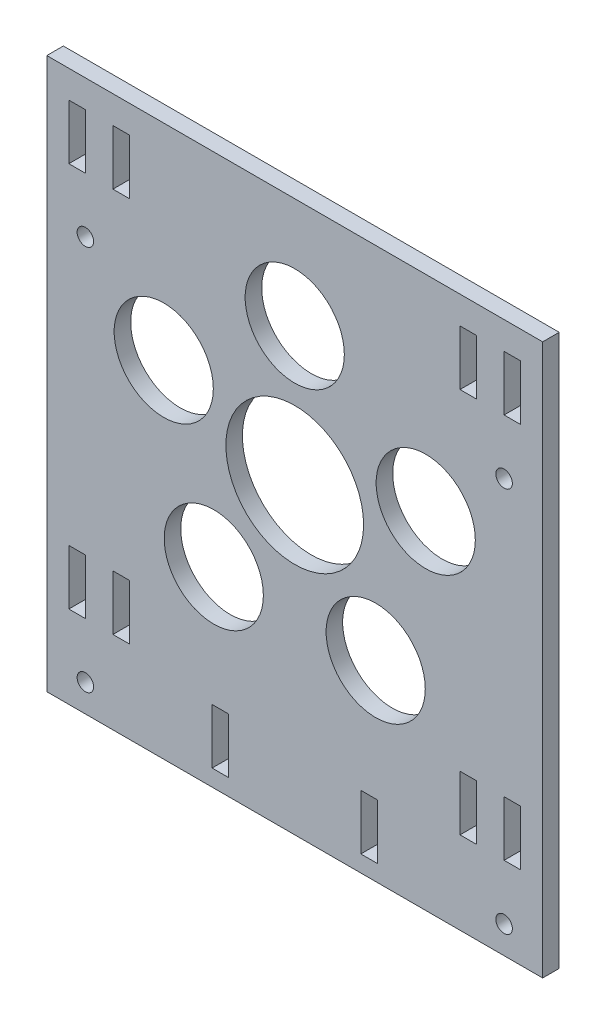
ISO-10303-21;
HEADER;
FILE_DESCRIPTION(('STEP AP214'),'2;1');
FILE_NAME('part.step','',(''),(''),'','','');
FILE_SCHEMA(('AUTOMOTIVE_DESIGN { 1 0 10303 214 1 1 1 1 }'));
ENDSEC;
DATA;
#1=APPLICATION_CONTEXT('core data for automotive mechanical design processes');
#2=APPLICATION_PROTOCOL_DEFINITION('international standard','automotive_design',2000,#1);
#3=PRODUCT_CONTEXT('',#1,'mechanical');
#4=PRODUCT('Part','Part','',(#3));
#5=PRODUCT_RELATED_PRODUCT_CATEGORY('part','',(#4));
#6=PRODUCT_DEFINITION_FORMATION('','',#4);
#7=PRODUCT_DEFINITION_CONTEXT('part definition',#1,'design');
#8=PRODUCT_DEFINITION('design','',#6,#7);
#9=PRODUCT_DEFINITION_SHAPE('','',#8);
#10=(LENGTH_UNIT() NAMED_UNIT(*) SI_UNIT(.MILLI.,.METRE.));
#11=(NAMED_UNIT(*) PLANE_ANGLE_UNIT() SI_UNIT($,.RADIAN.));
#12=(NAMED_UNIT(*) SI_UNIT($,.STERADIAN.) SOLID_ANGLE_UNIT());
#13=UNCERTAINTY_MEASURE_WITH_UNIT(LENGTH_MEASURE(1.E-05),#10,'distance_accuracy_value','');
#14=(GEOMETRIC_REPRESENTATION_CONTEXT(3) GLOBAL_UNCERTAINTY_ASSIGNED_CONTEXT((#13)) GLOBAL_UNIT_ASSIGNED_CONTEXT((#10,
#11,#12)) REPRESENTATION_CONTEXT('',''));
#15=CARTESIAN_POINT('',(0.,0.,0.));
#16=DIRECTION('',(0.,0.,1.));
#17=DIRECTION('',(1.,0.,0.));
#18=AXIS2_PLACEMENT_3D('',#15,#16,#17);
#19=CARTESIAN_POINT('',(44.9999999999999,1.2490009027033E-13,3.));
#20=DIRECTION('',(1.,0.,0.));
#21=DIRECTION('',(0.,1.,0.));
#22=AXIS2_PLACEMENT_3D('',#19,#20,#21);
#23=PLANE('',#22);
#24=DIRECTION('',(0.,-1.,0.));
#25=VECTOR('',#24,1.);
#26=CARTESIAN_POINT('',(44.9999999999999,1.2490009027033E-13,0.));
#27=LINE('',#26,#25);
#28=CARTESIAN_POINT('',(45.,45.,0.));
#29=VERTEX_POINT('',#28);
#30=CARTESIAN_POINT('',(45.,-55.,0.));
#31=VERTEX_POINT('',#30);
#32=EDGE_CURVE('E557',#29,#31,#27,.T.);
#33=ORIENTED_EDGE('',*,*,#32,.F.);
#34=DIRECTION('',(0.,0.,-1.));
#35=VECTOR('',#34,1.);
#36=CARTESIAN_POINT('',(45.,45.,3.));
#37=LINE('',#36,#35);
#38=CARTESIAN_POINT('',(45.,45.,3.));
#39=VERTEX_POINT('',#38);
#40=EDGE_CURVE('E592',#39,#29,#37,.T.);
#41=ORIENTED_EDGE('',*,*,#40,.F.);
#42=DIRECTION('',(0.,-1.,0.));
#43=VECTOR('',#42,1.);
#44=CARTESIAN_POINT('',(44.9999999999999,1.2490009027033E-13,3.));
#45=LINE('',#44,#43);
#46=CARTESIAN_POINT('',(45.,-55.,3.));
#47=VERTEX_POINT('',#46);
#48=EDGE_CURVE('E564',#39,#47,#45,.T.);
#49=ORIENTED_EDGE('',*,*,#48,.T.);
#50=DIRECTION('',(0.,0.,-1.));
#51=VECTOR('',#50,1.);
#52=CARTESIAN_POINT('',(45.,-55.,3.));
#53=LINE('',#52,#51);
#54=EDGE_CURVE('E576',#47,#31,#53,.T.);
#55=ORIENTED_EDGE('',*,*,#54,.T.);
#56=EDGE_LOOP('',(#33,#41,#49,#55));
#57=FACE_BOUND('',#56,.T.);
#58=ADVANCED_FACE('F34',(#57),#23,.T.);
#59=CARTESIAN_POINT('',(0.,45.,3.));
#60=DIRECTION('',(0.,1.,0.));
#61=DIRECTION('',(0.,0.,1.));
#62=AXIS2_PLACEMENT_3D('',#59,#60,#61);
#63=PLANE('',#62);
#64=DIRECTION('',(1.,0.,0.));
#65=VECTOR('',#64,1.);
#66=CARTESIAN_POINT('',(0.,45.,0.));
#67=LINE('',#66,#65);
#68=CARTESIAN_POINT('',(-45.,45.,0.));
#69=VERTEX_POINT('',#68);
#70=EDGE_CURVE('E579',#69,#29,#67,.T.);
#71=ORIENTED_EDGE('',*,*,#70,.F.);
#72=DIRECTION('',(0.,0.,-1.));
#73=VECTOR('',#72,1.);
#74=CARTESIAN_POINT('',(-45.,45.,3.));
#75=LINE('',#74,#73);
#76=CARTESIAN_POINT('',(-45.,45.,3.));
#77=VERTEX_POINT('',#76);
#78=EDGE_CURVE('E590',#77,#69,#75,.T.);
#79=ORIENTED_EDGE('',*,*,#78,.F.);
#80=DIRECTION('',(1.,0.,0.));
#81=VECTOR('',#80,1.);
#82=CARTESIAN_POINT('',(0.,45.,3.));
#83=LINE('',#82,#81);
#84=EDGE_CURVE('E567',#77,#39,#83,.T.);
#85=ORIENTED_EDGE('',*,*,#84,.T.);
#86=ORIENTED_EDGE('',*,*,#40,.T.);
#87=EDGE_LOOP('',(#71,#79,#85,#86));
#88=FACE_BOUND('',#87,.T.);
#89=ADVANCED_FACE('F748',(#88),#63,.T.);
#90=CARTESIAN_POINT('',(-45.,0.,3.));
#91=DIRECTION('',(-1.,0.,0.));
#92=DIRECTION('',(0.,-1.,0.));
#93=AXIS2_PLACEMENT_3D('',#90,#91,#92);
#94=PLANE('',#93);
#95=DIRECTION('',(0.,1.,0.));
#96=VECTOR('',#95,1.);
#97=CARTESIAN_POINT('',(-45.,0.,0.));
#98=LINE('',#97,#96);
#99=CARTESIAN_POINT('',(-45.,-55.,0.));
#100=VERTEX_POINT('',#99);
#101=EDGE_CURVE('E582',#100,#69,#98,.T.);
#102=ORIENTED_EDGE('',*,*,#101,.F.);
#103=DIRECTION('',(0.,0.,-1.));
#104=VECTOR('',#103,1.);
#105=CARTESIAN_POINT('',(-45.,-55.,3.));
#106=LINE('',#105,#104);
#107=CARTESIAN_POINT('',(-45.,-55.,3.));
#108=VERTEX_POINT('',#107);
#109=EDGE_CURVE('E588',#108,#100,#106,.T.);
#110=ORIENTED_EDGE('',*,*,#109,.F.);
#111=DIRECTION('',(0.,1.,0.));
#112=VECTOR('',#111,1.);
#113=CARTESIAN_POINT('',(-45.,0.,3.));
#114=LINE('',#113,#112);
#115=EDGE_CURVE('E571',#108,#77,#114,.T.);
#116=ORIENTED_EDGE('',*,*,#115,.T.);
#117=ORIENTED_EDGE('',*,*,#78,.T.);
#118=EDGE_LOOP('',(#102,#110,#116,#117));
#119=FACE_BOUND('',#118,.T.);
#120=ADVANCED_FACE('F753',(#119),#94,.T.);
#121=CARTESIAN_POINT('',(0.,-55.,3.));
#122=DIRECTION('',(0.,1.,0.));
#123=DIRECTION('',(0.,0.,1.));
#124=AXIS2_PLACEMENT_3D('',#121,#122,#123);
#125=PLANE('',#124);
#126=DIRECTION('',(1.,0.,0.));
#127=VECTOR('',#126,1.);
#128=CARTESIAN_POINT('',(0.,-55.,0.));
#129=LINE('',#128,#127);
#130=EDGE_CURVE('E568',#100,#31,#129,.T.);
#131=ORIENTED_EDGE('',*,*,#130,.T.);
#132=ORIENTED_EDGE('',*,*,#54,.F.);
#133=DIRECTION('',(1.,0.,0.));
#134=VECTOR('',#133,1.);
#135=CARTESIAN_POINT('',(0.,-55.,3.));
#136=LINE('',#135,#134);
#137=EDGE_CURVE('E574',#108,#47,#136,.T.);
#138=ORIENTED_EDGE('',*,*,#137,.F.);
#139=ORIENTED_EDGE('',*,*,#109,.T.);
#140=EDGE_LOOP('',(#131,#132,#138,#139));
#141=FACE_BOUND('',#140,.T.);
#142=ADVANCED_FACE('F768',(#141),#125,.F.);
#143=CARTESIAN_POINT('',(0.,0.,3.));
#144=DIRECTION('',(0.,0.,1.));
#145=DIRECTION('',(1.,0.,0.));
#146=AXIS2_PLACEMENT_3D('',#143,#144,#145);
#147=PLANE('',#146);
#148=CARTESIAN_POINT('',(-38.,20.,3.));
#149=DIRECTION('',(0.,0.,1.));
#150=DIRECTION('',(1.,0.,0.));
#151=AXIS2_PLACEMENT_3D('',#148,#149,#150);
#152=CIRCLE('',#151,1.5);
#153=CARTESIAN_POINT('',(-36.5,20.,3.));
#154=VERTEX_POINT('',#153);
#155=EDGE_CURVE('E357',#154,#154,#152,.T.);
#156=ORIENTED_EDGE('',*,*,#155,.F.);
#157=EDGE_LOOP('',(#156));
#158=FACE_BOUND('',#157,.T.);
#159=CARTESIAN_POINT('',(-38.,-50.,3.));
#160=DIRECTION('',(0.,0.,1.));
#161=DIRECTION('',(1.,0.,0.));
#162=AXIS2_PLACEMENT_3D('',#159,#160,#161);
#163=CIRCLE('',#162,1.5);
#164=CARTESIAN_POINT('',(-36.5,-50.,3.));
#165=VERTEX_POINT('',#164);
#166=EDGE_CURVE('E354',#165,#165,#163,.T.);
#167=ORIENTED_EDGE('',*,*,#166,.F.);
#168=EDGE_LOOP('',(#167));
#169=FACE_BOUND('',#168,.T.);
#170=DIRECTION('',(-1.,0.,0.));
#171=VECTOR('',#170,1.);
#172=CARTESIAN_POINT('',(-15.,-42.,3.));
#173=LINE('',#172,#171);
#174=CARTESIAN_POINT('',(-12.,-42.,3.));
#175=VERTEX_POINT('',#174);
#176=CARTESIAN_POINT('',(-15.,-42.,3.));
#177=VERTEX_POINT('',#176);
#178=EDGE_CURVE('E50',#175,#177,#173,.T.);
#179=ORIENTED_EDGE('',*,*,#178,.F.);
#180=DIRECTION('',(0.,1.,0.));
#181=VECTOR('',#180,1.);
#182=CARTESIAN_POINT('',(-12.,-42.,3.));
#183=LINE('',#182,#181);
#184=CARTESIAN_POINT('',(-12.,-52.,3.));
#185=VERTEX_POINT('',#184);
#186=EDGE_CURVE('E388',#185,#175,#183,.T.);
#187=ORIENTED_EDGE('',*,*,#186,.F.);
#188=DIRECTION('',(1.,0.,0.));
#189=VECTOR('',#188,1.);
#190=CARTESIAN_POINT('',(-12.,-52.,3.));
#191=LINE('',#190,#189);
#192=CARTESIAN_POINT('',(-15.,-52.,3.));
#193=VERTEX_POINT('',#192);
#194=EDGE_CURVE('E385',#193,#185,#191,.T.);
#195=ORIENTED_EDGE('',*,*,#194,.F.);
#196=DIRECTION('',(0.,-1.,0.));
#197=VECTOR('',#196,1.);
#198=CARTESIAN_POINT('',(-15.,-52.,3.));
#199=LINE('',#198,#197);
#200=EDGE_CURVE('E382',#177,#193,#199,.T.);
#201=ORIENTED_EDGE('',*,*,#200,.F.);
#202=EDGE_LOOP('',(#179,#187,#195,#201));
#203=FACE_BOUND('',#202,.T.);
#204=DIRECTION('',(1.,0.,0.));
#205=VECTOR('',#204,1.);
#206=CARTESIAN_POINT('',(-41.,30.,3.));
#207=LINE('',#206,#205);
#208=CARTESIAN_POINT('',(-41.,30.,3.));
#209=VERTEX_POINT('',#208);
#210=CARTESIAN_POINT('',(-38.,30.,3.));
#211=VERTEX_POINT('',#210);
#212=EDGE_CURVE('E58',#209,#211,#207,.T.);
#213=ORIENTED_EDGE('',*,*,#212,.F.);
#214=DIRECTION('',(0.,-1.,0.));
#215=VECTOR('',#214,1.);
#216=CARTESIAN_POINT('',(-41.,40.,3.));
#217=LINE('',#216,#215);
#218=CARTESIAN_POINT('',(-41.,40.,3.));
#219=VERTEX_POINT('',#218);
#220=EDGE_CURVE('E369',#219,#209,#217,.T.);
#221=ORIENTED_EDGE('',*,*,#220,.F.);
#222=DIRECTION('',(-1.,0.,0.));
#223=VECTOR('',#222,1.);
#224=CARTESIAN_POINT('',(-38.,40.,3.));
#225=LINE('',#224,#223);
#226=CARTESIAN_POINT('',(-38.,40.,3.));
#227=VERTEX_POINT('',#226);
#228=EDGE_CURVE('E366',#227,#219,#225,.T.);
#229=ORIENTED_EDGE('',*,*,#228,.F.);
#230=DIRECTION('',(0.,1.,0.));
#231=VECTOR('',#230,1.);
#232=CARTESIAN_POINT('',(-38.,30.,3.));
#233=LINE('',#232,#231);
#234=EDGE_CURVE('E362',#211,#227,#233,.T.);
#235=ORIENTED_EDGE('',*,*,#234,.F.);
#236=EDGE_LOOP('',(#213,#221,#229,#235));
#237=FACE_BOUND('',#236,.T.);
#238=DIRECTION('',(0.,1.,0.));
#239=VECTOR('',#238,1.);
#240=CARTESIAN_POINT('',(41.,40.,3.));
#241=LINE('',#240,#239);
#242=CARTESIAN_POINT('',(41.,30.,3.));
#243=VERTEX_POINT('',#242);
#244=CARTESIAN_POINT('',(41.,40.,3.));
#245=VERTEX_POINT('',#244);
#246=EDGE_CURVE('E351',#243,#245,#241,.T.);
#247=ORIENTED_EDGE('',*,*,#246,.F.);
#248=DIRECTION('',(1.,0.,0.));
#249=VECTOR('',#248,1.);
#250=CARTESIAN_POINT('',(41.,30.,3.));
#251=LINE('',#250,#249);
#252=CARTESIAN_POINT('',(38.,30.,3.));
#253=VERTEX_POINT('',#252);
#254=EDGE_CURVE('E427',#253,#243,#251,.T.);
#255=ORIENTED_EDGE('',*,*,#254,.F.);
#256=DIRECTION('',(0.,-1.,0.));
#257=VECTOR('',#256,1.);
#258=CARTESIAN_POINT('',(38.,30.,3.));
#259=LINE('',#258,#257);
#260=CARTESIAN_POINT('',(38.,40.,3.));
#261=VERTEX_POINT('',#260);
#262=EDGE_CURVE('E424',#261,#253,#259,.T.);
#263=ORIENTED_EDGE('',*,*,#262,.F.);
#264=DIRECTION('',(-1.,0.,0.));
#265=VECTOR('',#264,1.);
#266=CARTESIAN_POINT('',(38.,40.,3.));
#267=LINE('',#266,#265);
#268=EDGE_CURVE('E421',#245,#261,#267,.T.);
#269=ORIENTED_EDGE('',*,*,#268,.F.);
#270=EDGE_LOOP('',(#247,#255,#263,#269));
#271=FACE_BOUND('',#270,.T.);
#272=DIRECTION('',(0.,1.,0.));
#273=VECTOR('',#272,1.);
#274=CARTESIAN_POINT('',(15.,-52.,3.));
#275=LINE('',#274,#273);
#276=CARTESIAN_POINT('',(15.,-52.,3.));
#277=VERTEX_POINT('',#276);
#278=CARTESIAN_POINT('',(15.,-42.,3.));
#279=VERTEX_POINT('',#278);
#280=EDGE_CURVE('E398',#277,#279,#275,.T.);
#281=ORIENTED_EDGE('',*,*,#280,.F.);
#282=DIRECTION('',(1.,0.,0.));
#283=VECTOR('',#282,1.);
#284=CARTESIAN_POINT('',(12.,-52.,3.));
#285=LINE('',#284,#283);
#286=CARTESIAN_POINT('',(12.,-52.,3.));
#287=VERTEX_POINT('',#286);
#288=EDGE_CURVE('E407',#287,#277,#285,.T.);
#289=ORIENTED_EDGE('',*,*,#288,.F.);
#290=DIRECTION('',(0.,-1.,0.));
#291=VECTOR('',#290,1.);
#292=CARTESIAN_POINT('',(12.,-42.,3.));
#293=LINE('',#292,#291);
#294=CARTESIAN_POINT('',(12.,-42.,3.));
#295=VERTEX_POINT('',#294);
#296=EDGE_CURVE('E404',#295,#287,#293,.T.);
#297=ORIENTED_EDGE('',*,*,#296,.F.);
#298=DIRECTION('',(-1.,0.,0.));
#299=VECTOR('',#298,1.);
#300=CARTESIAN_POINT('',(15.,-42.,3.));
#301=LINE('',#300,#299);
#302=EDGE_CURVE('E400',#279,#295,#301,.T.);
#303=ORIENTED_EDGE('',*,*,#302,.F.);
#304=EDGE_LOOP('',(#281,#289,#297,#303));
#305=FACE_BOUND('',#304,.T.);
#306=CARTESIAN_POINT('',(38.,-50.,3.));
#307=DIRECTION('',(0.,0.,1.));
#308=DIRECTION('',(-1.,0.,0.));
#309=AXIS2_PLACEMENT_3D('',#306,#307,#308);
#310=CIRCLE('',#309,1.5);
#311=CARTESIAN_POINT('',(36.5,-50.,3.));
#312=VERTEX_POINT('',#311);
#313=EDGE_CURVE('E413',#312,#312,#310,.T.);
#314=ORIENTED_EDGE('',*,*,#313,.F.);
#315=EDGE_LOOP('',(#314));
#316=FACE_BOUND('',#315,.T.);
#317=CARTESIAN_POINT('',(38.,20.,3.));
#318=DIRECTION('',(0.,0.,1.));
#319=DIRECTION('',(-1.,0.,0.));
#320=AXIS2_PLACEMENT_3D('',#317,#318,#319);
#321=CIRCLE('',#320,1.5);
#322=CARTESIAN_POINT('',(36.5,20.,3.));
#323=VERTEX_POINT('',#322);
#324=EDGE_CURVE('E360',#323,#323,#321,.T.);
#325=ORIENTED_EDGE('',*,*,#324,.F.);
#326=EDGE_LOOP('',(#325));
#327=FACE_BOUND('',#326,.T.);
#328=DIRECTION('',(0.,1.,0.));
#329=VECTOR('',#328,1.);
#330=CARTESIAN_POINT('',(41.,-40.,3.));
#331=LINE('',#330,#329);
#332=CARTESIAN_POINT('',(41.,-40.,3.));
#333=VERTEX_POINT('',#332);
#334=CARTESIAN_POINT('',(41.,-30.,3.));
#335=VERTEX_POINT('',#334);
#336=EDGE_CURVE('E339',#333,#335,#331,.T.);
#337=ORIENTED_EDGE('',*,*,#336,.F.);
#338=DIRECTION('',(1.,0.,0.));
#339=VECTOR('',#338,1.);
#340=CARTESIAN_POINT('',(38.,-40.,3.));
#341=LINE('',#340,#339);
#342=CARTESIAN_POINT('',(38.,-40.,3.));
#343=VERTEX_POINT('',#342);
#344=EDGE_CURVE('E344',#343,#333,#341,.T.);
#345=ORIENTED_EDGE('',*,*,#344,.F.);
#346=DIRECTION('',(0.,-1.,0.));
#347=VECTOR('',#346,1.);
#348=CARTESIAN_POINT('',(38.,-30.,3.));
#349=LINE('',#348,#347);
#350=CARTESIAN_POINT('',(38.,-30.,3.));
#351=VERTEX_POINT('',#350);
#352=EDGE_CURVE('E323',#351,#343,#349,.T.);
#353=ORIENTED_EDGE('',*,*,#352,.F.);
#354=DIRECTION('',(-1.,0.,0.));
#355=VECTOR('',#354,1.);
#356=CARTESIAN_POINT('',(41.,-30.,3.));
#357=LINE('',#356,#355);
#358=EDGE_CURVE('E334',#335,#351,#357,.T.);
#359=ORIENTED_EDGE('',*,*,#358,.F.);
#360=EDGE_LOOP('',(#337,#345,#353,#359));
#361=FACE_BOUND('',#360,.T.);
#362=DIRECTION('',(-1.,0.,0.));
#363=VECTOR('',#362,1.);
#364=CARTESIAN_POINT('',(-41.,-30.,3.));
#365=LINE('',#364,#363);
#366=CARTESIAN_POINT('',(-38.,-30.,3.));
#367=VERTEX_POINT('',#366);
#368=CARTESIAN_POINT('',(-41.,-30.,3.));
#369=VERTEX_POINT('',#368);
#370=EDGE_CURVE('E375',#367,#369,#365,.T.);
#371=ORIENTED_EDGE('',*,*,#370,.F.);
#372=DIRECTION('',(0.,1.,0.));
#373=VECTOR('',#372,1.);
#374=CARTESIAN_POINT('',(-38.,-30.,3.));
#375=LINE('',#374,#373);
#376=CARTESIAN_POINT('',(-38.,-40.,3.));
#377=VERTEX_POINT('',#376);
#378=EDGE_CURVE('E449',#377,#367,#375,.T.);
#379=ORIENTED_EDGE('',*,*,#378,.F.);
#380=DIRECTION('',(1.,0.,0.));
#381=VECTOR('',#380,1.);
#382=CARTESIAN_POINT('',(-38.,-40.,3.));
#383=LINE('',#382,#381);
#384=CARTESIAN_POINT('',(-41.,-40.,3.));
#385=VERTEX_POINT('',#384);
#386=EDGE_CURVE('E446',#385,#377,#383,.T.);
#387=ORIENTED_EDGE('',*,*,#386,.F.);
#388=DIRECTION('',(0.,-1.,0.));
#389=VECTOR('',#388,1.);
#390=CARTESIAN_POINT('',(-41.,-40.,3.));
#391=LINE('',#390,#389);
#392=EDGE_CURVE('E443',#369,#385,#391,.T.);
#393=ORIENTED_EDGE('',*,*,#392,.F.);
#394=EDGE_LOOP('',(#371,#379,#387,#393));
#395=FACE_BOUND('',#394,.T.);
#396=CARTESIAN_POINT('',(0.,0.,3.));
#397=DIRECTION('',(0.,0.,1.));
#398=DIRECTION('',(1.,0.,0.));
#399=AXIS2_PLACEMENT_3D('',#396,#397,#398);
#400=CIRCLE('',#399,12.5);
#401=CARTESIAN_POINT('',(12.5,0.,3.));
#402=VERTEX_POINT('',#401);
#403=EDGE_CURVE('E462',#402,#402,#400,.T.);
#404=ORIENTED_EDGE('',*,*,#403,.F.);
#405=EDGE_LOOP('',(#404));
#406=FACE_BOUND('',#405,.T.);
#407=CARTESIAN_POINT('',(-23.7764129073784,7.72542485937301,3.));
#408=DIRECTION('',(0.,0.,1.));
#409=DIRECTION('',(1.,0.,0.));
#410=AXIS2_PLACEMENT_3D('',#407,#408,#409);
#411=CIRCLE('',#410,9.);
#412=CARTESIAN_POINT('',(-14.7764129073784,7.72542485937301,3.));
#413=VERTEX_POINT('',#412);
#414=EDGE_CURVE('E476',#413,#413,#411,.T.);
#415=ORIENTED_EDGE('',*,*,#414,.F.);
#416=EDGE_LOOP('',(#415));
#417=FACE_BOUND('',#416,.T.);
#418=CARTESIAN_POINT('',(-1.46100916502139E-12,25.0000000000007,3.));
#419=DIRECTION('',(0.,0.,1.));
#420=DIRECTION('',(1.,0.,0.));
#421=AXIS2_PLACEMENT_3D('',#418,#419,#420);
#422=CIRCLE('',#421,9.00000000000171);
#423=CARTESIAN_POINT('',(9.00000000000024,25.0000000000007,3.));
#424=VERTEX_POINT('',#423);
#425=EDGE_CURVE('E473',#424,#424,#422,.T.);
#426=ORIENTED_EDGE('',*,*,#425,.F.);
#427=EDGE_LOOP('',(#426));
#428=FACE_BOUND('',#427,.T.);
#429=CARTESIAN_POINT('',(-14.6946313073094,-20.2254248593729,3.));
#430=DIRECTION('',(0.,0.,1.));
#431=DIRECTION('',(1.,0.,0.));
#432=AXIS2_PLACEMENT_3D('',#429,#430,#431);
#433=CIRCLE('',#432,8.99999999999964);
#434=CARTESIAN_POINT('',(-5.69463130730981,-20.2254248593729,3.));
#435=VERTEX_POINT('',#434);
#436=EDGE_CURVE('E470',#435,#435,#433,.T.);
#437=ORIENTED_EDGE('',*,*,#436,.F.);
#438=EDGE_LOOP('',(#437));
#439=FACE_BOUND('',#438,.T.);
#440=CARTESIAN_POINT('',(14.6946313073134,-20.2254248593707,3.));
#441=DIRECTION('',(0.,0.,1.));
#442=DIRECTION('',(1.,0.,0.));
#443=AXIS2_PLACEMENT_3D('',#440,#441,#442);
#444=CIRCLE('',#443,9.00000000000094);
#445=CARTESIAN_POINT('',(23.6946313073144,-20.2254248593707,3.));
#446=VERTEX_POINT('',#445);
#447=EDGE_CURVE('E466',#446,#446,#444,.T.);
#448=ORIENTED_EDGE('',*,*,#447,.F.);
#449=EDGE_LOOP('',(#448));
#450=FACE_BOUND('',#449,.T.);
#451=CARTESIAN_POINT('',(23.7764129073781,7.72542485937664,3.));
#452=DIRECTION('',(0.,0.,1.));
#453=DIRECTION('',(1.,0.,0.));
#454=AXIS2_PLACEMENT_3D('',#451,#452,#453);
#455=CIRCLE('',#454,9.00000000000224);
#456=CARTESIAN_POINT('',(32.7764129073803,7.72542485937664,3.));
#457=VERTEX_POINT('',#456);
#458=EDGE_CURVE('E469',#457,#457,#455,.T.);
#459=ORIENTED_EDGE('',*,*,#458,.F.);
#460=EDGE_LOOP('',(#459));
#461=FACE_BOUND('',#460,.T.);
#462=DIRECTION('',(-1.,0.,0.));
#463=VECTOR('',#462,1.);
#464=CARTESIAN_POINT('',(33.,40.,3.));
#465=LINE('',#464,#463);
#466=CARTESIAN_POINT('',(33.,40.,3.));
#467=VERTEX_POINT('',#466);
#468=CARTESIAN_POINT('',(30.,40.,3.));
#469=VERTEX_POINT('',#468);
#470=EDGE_CURVE('E504',#467,#469,#465,.T.);
#471=ORIENTED_EDGE('',*,*,#470,.F.);
#472=DIRECTION('',(0.,1.,0.));
#473=VECTOR('',#472,1.);
#474=CARTESIAN_POINT('',(33.,30.,3.));
#475=LINE('',#474,#473);
#476=CARTESIAN_POINT('',(33.,30.,3.));
#477=VERTEX_POINT('',#476);
#478=EDGE_CURVE('E513',#477,#467,#475,.T.);
#479=ORIENTED_EDGE('',*,*,#478,.F.);
#480=DIRECTION('',(1.,0.,0.));
#481=VECTOR('',#480,1.);
#482=CARTESIAN_POINT('',(30.,30.,3.));
#483=LINE('',#482,#481);
#484=CARTESIAN_POINT('',(30.,30.,3.));
#485=VERTEX_POINT('',#484);
#486=EDGE_CURVE('E510',#485,#477,#483,.T.);
#487=ORIENTED_EDGE('',*,*,#486,.F.);
#488=DIRECTION('',(0.,-1.,0.));
#489=VECTOR('',#488,1.);
#490=CARTESIAN_POINT('',(30.,40.,3.));
#491=LINE('',#490,#489);
#492=EDGE_CURVE('E506',#469,#485,#491,.T.);
#493=ORIENTED_EDGE('',*,*,#492,.F.);
#494=EDGE_LOOP('',(#471,#479,#487,#493));
#495=FACE_BOUND('',#494,.T.);
#496=DIRECTION('',(-1.,0.,0.));
#497=VECTOR('',#496,1.);
#498=CARTESIAN_POINT('',(-30.,-30.,3.));
#499=LINE('',#498,#497);
#500=CARTESIAN_POINT('',(-30.,-30.,3.));
#501=VERTEX_POINT('',#500);
#502=CARTESIAN_POINT('',(-33.,-30.,3.));
#503=VERTEX_POINT('',#502);
#504=EDGE_CURVE('E497',#501,#503,#499,.T.);
#505=ORIENTED_EDGE('',*,*,#504,.F.);
#506=DIRECTION('',(0.,1.,0.));
#507=VECTOR('',#506,1.);
#508=CARTESIAN_POINT('',(-30.,-40.,3.));
#509=LINE('',#508,#507);
#510=CARTESIAN_POINT('',(-30.,-40.,3.));
#511=VERTEX_POINT('',#510);
#512=EDGE_CURVE('E533',#511,#501,#509,.T.);
#513=ORIENTED_EDGE('',*,*,#512,.F.);
#514=DIRECTION('',(1.,0.,0.));
#515=VECTOR('',#514,1.);
#516=CARTESIAN_POINT('',(-33.,-40.,3.));
#517=LINE('',#516,#515);
#518=CARTESIAN_POINT('',(-33.,-40.,3.));
#519=VERTEX_POINT('',#518);
#520=EDGE_CURVE('E530',#519,#511,#517,.T.);
#521=ORIENTED_EDGE('',*,*,#520,.F.);
#522=DIRECTION('',(0.,-1.,0.));
#523=VECTOR('',#522,1.);
#524=CARTESIAN_POINT('',(-33.,-30.,3.));
#525=LINE('',#524,#523);
#526=EDGE_CURVE('E527',#503,#519,#525,.T.);
#527=ORIENTED_EDGE('',*,*,#526,.F.);
#528=EDGE_LOOP('',(#505,#513,#521,#527));
#529=FACE_BOUND('',#528,.T.);
#530=DIRECTION('',(-1.,0.,0.));
#531=VECTOR('',#530,1.);
#532=CARTESIAN_POINT('',(33.,-30.,3.));
#533=LINE('',#532,#531);
#534=CARTESIAN_POINT('',(33.,-30.,3.));
#535=VERTEX_POINT('',#534);
#536=CARTESIAN_POINT('',(30.,-30.,3.));
#537=VERTEX_POINT('',#536);
#538=EDGE_CURVE('E482',#535,#537,#533,.T.);
#539=ORIENTED_EDGE('',*,*,#538,.F.);
#540=DIRECTION('',(0.,1.,0.));
#541=VECTOR('',#540,1.);
#542=CARTESIAN_POINT('',(33.,-40.,3.));
#543=LINE('',#542,#541);
#544=CARTESIAN_POINT('',(33.,-40.,3.));
#545=VERTEX_POINT('',#544);
#546=EDGE_CURVE('E491',#545,#535,#543,.T.);
#547=ORIENTED_EDGE('',*,*,#546,.F.);
#548=DIRECTION('',(1.,0.,0.));
#549=VECTOR('',#548,1.);
#550=CARTESIAN_POINT('',(30.,-40.,3.));
#551=LINE('',#550,#549);
#552=CARTESIAN_POINT('',(30.,-40.,3.));
#553=VERTEX_POINT('',#552);
#554=EDGE_CURVE('E488',#553,#545,#551,.T.);
#555=ORIENTED_EDGE('',*,*,#554,.F.);
#556=DIRECTION('',(0.,-1.,0.));
#557=VECTOR('',#556,1.);
#558=CARTESIAN_POINT('',(30.,-30.,3.));
#559=LINE('',#558,#557);
#560=EDGE_CURVE('E484',#537,#553,#559,.T.);
#561=ORIENTED_EDGE('',*,*,#560,.F.);
#562=EDGE_LOOP('',(#539,#547,#555,#561));
#563=FACE_BOUND('',#562,.T.);
#564=DIRECTION('',(-1.,0.,0.));
#565=VECTOR('',#564,1.);
#566=CARTESIAN_POINT('',(-30.,40.,3.));
#567=LINE('',#566,#565);
#568=CARTESIAN_POINT('',(-30.,40.,3.));
#569=VERTEX_POINT('',#568);
#570=CARTESIAN_POINT('',(-33.,40.,3.));
#571=VERTEX_POINT('',#570);
#572=EDGE_CURVE('E519',#569,#571,#567,.T.);
#573=ORIENTED_EDGE('',*,*,#572,.F.);
#574=DIRECTION('',(0.,1.,0.));
#575=VECTOR('',#574,1.);
#576=CARTESIAN_POINT('',(-30.,30.,3.));
#577=LINE('',#576,#575);
#578=CARTESIAN_POINT('',(-30.,30.,3.));
#579=VERTEX_POINT('',#578);
#580=EDGE_CURVE('E551',#579,#569,#577,.T.);
#581=ORIENTED_EDGE('',*,*,#580,.F.);
#582=DIRECTION('',(1.,0.,0.));
#583=VECTOR('',#582,1.);
#584=CARTESIAN_POINT('',(-33.,30.,3.));
#585=LINE('',#584,#583);
#586=CARTESIAN_POINT('',(-33.,30.,3.));
#587=VERTEX_POINT('',#586);
#588=EDGE_CURVE('E548',#587,#579,#585,.T.);
#589=ORIENTED_EDGE('',*,*,#588,.F.);
#590=DIRECTION('',(0.,-1.,0.));
#591=VECTOR('',#590,1.);
#592=CARTESIAN_POINT('',(-33.,40.,3.));
#593=LINE('',#592,#591);
#594=EDGE_CURVE('E545',#571,#587,#593,.T.);
#595=ORIENTED_EDGE('',*,*,#594,.F.);
#596=EDGE_LOOP('',(#573,#581,#589,#595));
#597=FACE_BOUND('',#596,.T.);
#598=ORIENTED_EDGE('',*,*,#48,.F.);
#599=ORIENTED_EDGE('',*,*,#84,.F.);
#600=ORIENTED_EDGE('',*,*,#115,.F.);
#601=ORIENTED_EDGE('',*,*,#137,.T.);
#602=EDGE_LOOP('',(#598,#599,#600,#601));
#603=FACE_BOUND('',#602,.T.);
#604=ADVANCED_FACE('F341',(#158,#169,#203,#237,#271,#305,#316,#327,#361,#395,#406,#417,#428,
#439,#450,#461,#495,#529,#563,#597,#603),#147,.T.);
#605=CARTESIAN_POINT('',(0.,0.,0.));
#606=DIRECTION('',(0.,0.,1.));
#607=DIRECTION('',(1.,0.,0.));
#608=AXIS2_PLACEMENT_3D('',#605,#606,#607);
#609=PLANE('',#608);
#610=CARTESIAN_POINT('',(-38.,20.,0.));
#611=DIRECTION('',(0.,0.,1.));
#612=DIRECTION('',(1.,0.,0.));
#613=AXIS2_PLACEMENT_3D('',#610,#611,#612);
#614=CIRCLE('',#613,1.5);
#615=CARTESIAN_POINT('',(-36.5,20.,0.));
#616=VERTEX_POINT('',#615);
#617=EDGE_CURVE('E37',#616,#616,#614,.T.);
#618=ORIENTED_EDGE('',*,*,#617,.T.);
#619=EDGE_LOOP('',(#618));
#620=FACE_BOUND('',#619,.T.);
#621=CARTESIAN_POINT('',(-38.,-50.,0.));
#622=DIRECTION('',(0.,0.,1.));
#623=DIRECTION('',(1.,0.,0.));
#624=AXIS2_PLACEMENT_3D('',#621,#622,#623);
#625=CIRCLE('',#624,1.5);
#626=CARTESIAN_POINT('',(-36.5,-50.,0.));
#627=VERTEX_POINT('',#626);
#628=EDGE_CURVE('E684',#627,#627,#625,.T.);
#629=ORIENTED_EDGE('',*,*,#628,.T.);
#630=EDGE_LOOP('',(#629));
#631=FACE_BOUND('',#630,.T.);
#632=DIRECTION('',(0.,1.,0.));
#633=VECTOR('',#632,1.);
#634=CARTESIAN_POINT('',(-12.,0.,0.));
#635=LINE('',#634,#633);
#636=CARTESIAN_POINT('',(-12.,-52.,0.));
#637=VERTEX_POINT('',#636);
#638=CARTESIAN_POINT('',(-12.,-42.,0.));
#639=VERTEX_POINT('',#638);
#640=EDGE_CURVE('E42',#637,#639,#635,.T.);
#641=ORIENTED_EDGE('',*,*,#640,.T.);
#642=DIRECTION('',(-1.,0.,0.));
#643=VECTOR('',#642,1.);
#644=CARTESIAN_POINT('',(0.,-42.,0.));
#645=LINE('',#644,#643);
#646=CARTESIAN_POINT('',(-15.,-42.,0.));
#647=VERTEX_POINT('',#646);
#648=EDGE_CURVE('E11',#639,#647,#645,.T.);
#649=ORIENTED_EDGE('',*,*,#648,.T.);
#650=DIRECTION('',(0.,-1.,0.));
#651=VECTOR('',#650,1.);
#652=CARTESIAN_POINT('',(-15.,0.,0.));
#653=LINE('',#652,#651);
#654=CARTESIAN_POINT('',(-15.,-52.,0.));
#655=VERTEX_POINT('',#654);
#656=EDGE_CURVE('E720',#647,#655,#653,.T.);
#657=ORIENTED_EDGE('',*,*,#656,.T.);
#658=DIRECTION('',(1.,0.,0.));
#659=VECTOR('',#658,1.);
#660=CARTESIAN_POINT('',(0.,-52.,0.));
#661=LINE('',#660,#659);
#662=EDGE_CURVE('E723',#655,#637,#661,.T.);
#663=ORIENTED_EDGE('',*,*,#662,.T.);
#664=EDGE_LOOP('',(#641,#649,#657,#663));
#665=FACE_BOUND('',#664,.T.);
#666=DIRECTION('',(0.,-1.,0.));
#667=VECTOR('',#666,1.);
#668=CARTESIAN_POINT('',(-41.,0.,0.));
#669=LINE('',#668,#667);
#670=CARTESIAN_POINT('',(-41.,40.,0.));
#671=VERTEX_POINT('',#670);
#672=CARTESIAN_POINT('',(-41.,30.,0.));
#673=VERTEX_POINT('',#672);
#674=EDGE_CURVE('E714',#671,#673,#669,.T.);
#675=ORIENTED_EDGE('',*,*,#674,.T.);
#676=DIRECTION('',(1.,0.,0.));
#677=VECTOR('',#676,1.);
#678=CARTESIAN_POINT('',(0.,30.,0.));
#679=LINE('',#678,#677);
#680=CARTESIAN_POINT('',(-38.,30.,0.));
#681=VERTEX_POINT('',#680);
#682=EDGE_CURVE('E717',#673,#681,#679,.T.);
#683=ORIENTED_EDGE('',*,*,#682,.T.);
#684=DIRECTION('',(0.,1.,0.));
#685=VECTOR('',#684,1.);
#686=CARTESIAN_POINT('',(-38.,0.,0.));
#687=LINE('',#686,#685);
#688=CARTESIAN_POINT('',(-38.,40.,0.));
#689=VERTEX_POINT('',#688);
#690=EDGE_CURVE('E708',#681,#689,#687,.T.);
#691=ORIENTED_EDGE('',*,*,#690,.T.);
#692=DIRECTION('',(-1.,0.,0.));
#693=VECTOR('',#692,1.);
#694=CARTESIAN_POINT('',(0.,40.,0.));
#695=LINE('',#694,#693);
#696=EDGE_CURVE('E711',#689,#671,#695,.T.);
#697=ORIENTED_EDGE('',*,*,#696,.T.);
#698=EDGE_LOOP('',(#675,#683,#691,#697));
#699=FACE_BOUND('',#698,.T.);
#700=DIRECTION('',(1.,0.,0.));
#701=VECTOR('',#700,1.);
#702=CARTESIAN_POINT('',(0.,30.,0.));
#703=LINE('',#702,#701);
#704=CARTESIAN_POINT('',(38.,30.,0.));
#705=VERTEX_POINT('',#704);
#706=CARTESIAN_POINT('',(41.,30.,0.));
#707=VERTEX_POINT('',#706);
#708=EDGE_CURVE('E702',#705,#707,#703,.T.);
#709=ORIENTED_EDGE('',*,*,#708,.T.);
#710=DIRECTION('',(0.,1.,0.));
#711=VECTOR('',#710,1.);
#712=CARTESIAN_POINT('',(41.,0.,0.));
#713=LINE('',#712,#711);
#714=CARTESIAN_POINT('',(41.,40.,0.));
#715=VERTEX_POINT('',#714);
#716=EDGE_CURVE('E705',#707,#715,#713,.T.);
#717=ORIENTED_EDGE('',*,*,#716,.T.);
#718=DIRECTION('',(-1.,0.,0.));
#719=VECTOR('',#718,1.);
#720=CARTESIAN_POINT('',(0.,40.,0.));
#721=LINE('',#720,#719);
#722=CARTESIAN_POINT('',(38.,40.,0.));
#723=VERTEX_POINT('',#722);
#724=EDGE_CURVE('E696',#715,#723,#721,.T.);
#725=ORIENTED_EDGE('',*,*,#724,.T.);
#726=DIRECTION('',(0.,-1.,0.));
#727=VECTOR('',#726,1.);
#728=CARTESIAN_POINT('',(38.,0.,0.));
#729=LINE('',#728,#727);
#730=EDGE_CURVE('E699',#723,#705,#729,.T.);
#731=ORIENTED_EDGE('',*,*,#730,.T.);
#732=EDGE_LOOP('',(#709,#717,#725,#731));
#733=FACE_BOUND('',#732,.T.);
#734=DIRECTION('',(1.,0.,0.));
#735=VECTOR('',#734,1.);
#736=CARTESIAN_POINT('',(0.,-52.,0.));
#737=LINE('',#736,#735);
#738=CARTESIAN_POINT('',(12.,-52.,0.));
#739=VERTEX_POINT('',#738);
#740=CARTESIAN_POINT('',(15.,-52.,0.));
#741=VERTEX_POINT('',#740);
#742=EDGE_CURVE('E690',#739,#741,#737,.T.);
#743=ORIENTED_EDGE('',*,*,#742,.T.);
#744=DIRECTION('',(0.,1.,0.));
#745=VECTOR('',#744,1.);
#746=CARTESIAN_POINT('',(15.,0.,0.));
#747=LINE('',#746,#745);
#748=CARTESIAN_POINT('',(15.,-42.,0.));
#749=VERTEX_POINT('',#748);
#750=EDGE_CURVE('E693',#741,#749,#747,.T.);
#751=ORIENTED_EDGE('',*,*,#750,.T.);
#752=DIRECTION('',(-1.,0.,0.));
#753=VECTOR('',#752,1.);
#754=CARTESIAN_POINT('',(0.,-42.,0.));
#755=LINE('',#754,#753);
#756=CARTESIAN_POINT('',(12.,-42.,0.));
#757=VERTEX_POINT('',#756);
#758=EDGE_CURVE('E678',#749,#757,#755,.T.);
#759=ORIENTED_EDGE('',*,*,#758,.T.);
#760=DIRECTION('',(0.,-1.,0.));
#761=VECTOR('',#760,1.);
#762=CARTESIAN_POINT('',(12.,0.,0.));
#763=LINE('',#762,#761);
#764=EDGE_CURVE('E687',#757,#739,#763,.T.);
#765=ORIENTED_EDGE('',*,*,#764,.T.);
#766=EDGE_LOOP('',(#743,#751,#759,#765));
#767=FACE_BOUND('',#766,.T.);
#768=CARTESIAN_POINT('',(38.,-50.,0.));
#769=DIRECTION('',(0.,0.,1.));
#770=DIRECTION('',(1.,0.,0.));
#771=AXIS2_PLACEMENT_3D('',#768,#769,#770);
#772=CIRCLE('',#771,1.5);
#773=CARTESIAN_POINT('',(39.5,-50.,0.));
#774=VERTEX_POINT('',#773);
#775=EDGE_CURVE('E681',#774,#774,#772,.T.);
#776=ORIENTED_EDGE('',*,*,#775,.T.);
#777=EDGE_LOOP('',(#776));
#778=FACE_BOUND('',#777,.T.);
#779=CARTESIAN_POINT('',(38.,20.,0.));
#780=DIRECTION('',(0.,0.,1.));
#781=DIRECTION('',(1.,0.,0.));
#782=AXIS2_PLACEMENT_3D('',#779,#780,#781);
#783=CIRCLE('',#782,1.5);
#784=CARTESIAN_POINT('',(39.5,20.,0.));
#785=VERTEX_POINT('',#784);
#786=EDGE_CURVE('E455',#785,#785,#783,.T.);
#787=ORIENTED_EDGE('',*,*,#786,.T.);
#788=EDGE_LOOP('',(#787));
#789=FACE_BOUND('',#788,.T.);
#790=DIRECTION('',(1.,0.,0.));
#791=VECTOR('',#790,1.);
#792=CARTESIAN_POINT('',(0.,-40.0000000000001,0.));
#793=LINE('',#792,#791);
#794=CARTESIAN_POINT('',(38.,-40.,0.));
#795=VERTEX_POINT('',#794);
#796=CARTESIAN_POINT('',(41.,-40.,0.));
#797=VERTEX_POINT('',#796);
#798=EDGE_CURVE('E672',#795,#797,#793,.T.);
#799=ORIENTED_EDGE('',*,*,#798,.T.);
#800=DIRECTION('',(0.,1.,0.));
#801=VECTOR('',#800,1.);
#802=CARTESIAN_POINT('',(41.,0.,0.));
#803=LINE('',#802,#801);
#804=CARTESIAN_POINT('',(41.,-30.,0.));
#805=VERTEX_POINT('',#804);
#806=EDGE_CURVE('E675',#797,#805,#803,.T.);
#807=ORIENTED_EDGE('',*,*,#806,.T.);
#808=DIRECTION('',(-1.,0.,0.));
#809=VECTOR('',#808,1.);
#810=CARTESIAN_POINT('',(0.,-30.,0.));
#811=LINE('',#810,#809);
#812=CARTESIAN_POINT('',(38.,-30.,0.));
#813=VERTEX_POINT('',#812);
#814=EDGE_CURVE('E669',#805,#813,#811,.T.);
#815=ORIENTED_EDGE('',*,*,#814,.T.);
#816=DIRECTION('',(0.,-1.,0.));
#817=VECTOR('',#816,1.);
#818=CARTESIAN_POINT('',(38.,0.,0.));
#819=LINE('',#818,#817);
#820=EDGE_CURVE('E326',#813,#795,#819,.T.);
#821=ORIENTED_EDGE('',*,*,#820,.T.);
#822=EDGE_LOOP('',(#799,#807,#815,#821));
#823=FACE_BOUND('',#822,.T.);
#824=DIRECTION('',(0.,1.,0.));
#825=VECTOR('',#824,1.);
#826=CARTESIAN_POINT('',(-38.,0.,0.));
#827=LINE('',#826,#825);
#828=CARTESIAN_POINT('',(-38.,-40.,0.));
#829=VERTEX_POINT('',#828);
#830=CARTESIAN_POINT('',(-38.,-30.,0.));
#831=VERTEX_POINT('',#830);
#832=EDGE_CURVE('E663',#829,#831,#827,.T.);
#833=ORIENTED_EDGE('',*,*,#832,.T.);
#834=DIRECTION('',(-1.,0.,0.));
#835=VECTOR('',#834,1.);
#836=CARTESIAN_POINT('',(0.,-30.,0.));
#837=LINE('',#836,#835);
#838=CARTESIAN_POINT('',(-41.,-30.,0.));
#839=VERTEX_POINT('',#838);
#840=EDGE_CURVE('E666',#831,#839,#837,.T.);
#841=ORIENTED_EDGE('',*,*,#840,.T.);
#842=DIRECTION('',(0.,-1.,0.));
#843=VECTOR('',#842,1.);
#844=CARTESIAN_POINT('',(-41.,0.,0.));
#845=LINE('',#844,#843);
#846=CARTESIAN_POINT('',(-41.,-40.,0.));
#847=VERTEX_POINT('',#846);
#848=EDGE_CURVE('E642',#839,#847,#845,.T.);
#849=ORIENTED_EDGE('',*,*,#848,.T.);
#850=DIRECTION('',(1.,0.,0.));
#851=VECTOR('',#850,1.);
#852=CARTESIAN_POINT('',(0.,-40.0000000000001,0.));
#853=LINE('',#852,#851);
#854=EDGE_CURVE('E660',#847,#829,#853,.T.);
#855=ORIENTED_EDGE('',*,*,#854,.T.);
#856=EDGE_LOOP('',(#833,#841,#849,#855));
#857=FACE_BOUND('',#856,.T.);
#858=CARTESIAN_POINT('',(0.,0.,0.));
#859=DIRECTION('',(0.,0.,1.));
#860=DIRECTION('',(1.,0.,0.));
#861=AXIS2_PLACEMENT_3D('',#858,#859,#860);
#862=CIRCLE('',#861,12.5);
#863=CARTESIAN_POINT('',(12.5,0.,0.));
#864=VERTEX_POINT('',#863);
#865=EDGE_CURVE('E465',#864,#864,#862,.T.);
#866=ORIENTED_EDGE('',*,*,#865,.T.);
#867=EDGE_LOOP('',(#866));
#868=FACE_BOUND('',#867,.T.);
#869=CARTESIAN_POINT('',(-23.7764129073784,7.72542485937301,0.));
#870=DIRECTION('',(0.,0.,1.));
#871=DIRECTION('',(1.,0.,0.));
#872=AXIS2_PLACEMENT_3D('',#869,#870,#871);
#873=CIRCLE('',#872,9.);
#874=CARTESIAN_POINT('',(-14.7764129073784,7.72542485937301,0.));
#875=VERTEX_POINT('',#874);
#876=EDGE_CURVE('E485',#875,#875,#873,.T.);
#877=ORIENTED_EDGE('',*,*,#876,.T.);
#878=EDGE_LOOP('',(#877));
#879=FACE_BOUND('',#878,.T.);
#880=CARTESIAN_POINT('',(-1.46100916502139E-12,25.0000000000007,0.));
#881=DIRECTION('',(0.,0.,1.));
#882=DIRECTION('',(1.,0.,0.));
#883=AXIS2_PLACEMENT_3D('',#880,#881,#882);
#884=CIRCLE('',#883,9.00000000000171);
#885=CARTESIAN_POINT('',(9.00000000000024,25.0000000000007,0.));
#886=VERTEX_POINT('',#885);
#887=EDGE_CURVE('E651',#886,#886,#884,.T.);
#888=ORIENTED_EDGE('',*,*,#887,.T.);
#889=EDGE_LOOP('',(#888));
#890=FACE_BOUND('',#889,.T.);
#891=CARTESIAN_POINT('',(-14.6946313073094,-20.2254248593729,0.));
#892=DIRECTION('',(0.,0.,1.));
#893=DIRECTION('',(1.,0.,0.));
#894=AXIS2_PLACEMENT_3D('',#891,#892,#893);
#895=CIRCLE('',#894,8.99999999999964);
#896=CARTESIAN_POINT('',(-5.69463130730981,-20.2254248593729,0.));
#897=VERTEX_POINT('',#896);
#898=EDGE_CURVE('E648',#897,#897,#895,.T.);
#899=ORIENTED_EDGE('',*,*,#898,.T.);
#900=EDGE_LOOP('',(#899));
#901=FACE_BOUND('',#900,.T.);
#902=CARTESIAN_POINT('',(14.6946313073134,-20.2254248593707,0.));
#903=DIRECTION('',(0.,0.,1.));
#904=DIRECTION('',(1.,0.,0.));
#905=AXIS2_PLACEMENT_3D('',#902,#903,#904);
#906=CIRCLE('',#905,9.00000000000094);
#907=CARTESIAN_POINT('',(23.6946313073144,-20.2254248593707,0.));
#908=VERTEX_POINT('',#907);
#909=EDGE_CURVE('E645',#908,#908,#906,.T.);
#910=ORIENTED_EDGE('',*,*,#909,.T.);
#911=EDGE_LOOP('',(#910));
#912=FACE_BOUND('',#911,.T.);
#913=CARTESIAN_POINT('',(23.7764129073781,7.72542485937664,0.));
#914=DIRECTION('',(0.,0.,1.));
#915=DIRECTION('',(1.,0.,0.));
#916=AXIS2_PLACEMENT_3D('',#913,#914,#915);
#917=CIRCLE('',#916,9.00000000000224);
#918=CARTESIAN_POINT('',(32.7764129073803,7.72542485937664,0.));
#919=VERTEX_POINT('',#918);
#920=EDGE_CURVE('E481',#919,#919,#917,.T.);
#921=ORIENTED_EDGE('',*,*,#920,.T.);
#922=EDGE_LOOP('',(#921));
#923=FACE_BOUND('',#922,.T.);
#924=DIRECTION('',(0.,1.,0.));
#925=VECTOR('',#924,1.);
#926=CARTESIAN_POINT('',(33.,0.,0.));
#927=LINE('',#926,#925);
#928=CARTESIAN_POINT('',(33.,30.,0.));
#929=VERTEX_POINT('',#928);
#930=CARTESIAN_POINT('',(33.,40.,0.));
#931=VERTEX_POINT('',#930);
#932=EDGE_CURVE('E636',#929,#931,#927,.T.);
#933=ORIENTED_EDGE('',*,*,#932,.T.);
#934=DIRECTION('',(-1.,0.,0.));
#935=VECTOR('',#934,1.);
#936=CARTESIAN_POINT('',(0.,40.,0.));
#937=LINE('',#936,#935);
#938=CARTESIAN_POINT('',(30.,40.,0.));
#939=VERTEX_POINT('',#938);
#940=EDGE_CURVE('E639',#931,#939,#937,.T.);
#941=ORIENTED_EDGE('',*,*,#940,.T.);
#942=DIRECTION('',(0.,-1.,0.));
#943=VECTOR('',#942,1.);
#944=CARTESIAN_POINT('',(30.,0.,0.));
#945=LINE('',#944,#943);
#946=CARTESIAN_POINT('',(30.,30.,0.));
#947=VERTEX_POINT('',#946);
#948=EDGE_CURVE('E630',#939,#947,#945,.T.);
#949=ORIENTED_EDGE('',*,*,#948,.T.);
#950=DIRECTION('',(1.,0.,0.));
#951=VECTOR('',#950,1.);
#952=CARTESIAN_POINT('',(0.,30.,0.));
#953=LINE('',#952,#951);
#954=EDGE_CURVE('E633',#947,#929,#953,.T.);
#955=ORIENTED_EDGE('',*,*,#954,.T.);
#956=EDGE_LOOP('',(#933,#941,#949,#955));
#957=FACE_BOUND('',#956,.T.);
#958=DIRECTION('',(0.,1.,0.));
#959=VECTOR('',#958,1.);
#960=CARTESIAN_POINT('',(-30.,0.,0.));
#961=LINE('',#960,#959);
#962=CARTESIAN_POINT('',(-30.,-40.,0.));
#963=VERTEX_POINT('',#962);
#964=CARTESIAN_POINT('',(-30.,-30.,0.));
#965=VERTEX_POINT('',#964);
#966=EDGE_CURVE('E624',#963,#965,#961,.T.);
#967=ORIENTED_EDGE('',*,*,#966,.T.);
#968=DIRECTION('',(-1.,0.,0.));
#969=VECTOR('',#968,1.);
#970=CARTESIAN_POINT('',(0.,-30.,0.));
#971=LINE('',#970,#969);
#972=CARTESIAN_POINT('',(-33.,-30.,0.));
#973=VERTEX_POINT('',#972);
#974=EDGE_CURVE('E627',#965,#973,#971,.T.);
#975=ORIENTED_EDGE('',*,*,#974,.T.);
#976=DIRECTION('',(0.,-1.,0.));
#977=VECTOR('',#976,1.);
#978=CARTESIAN_POINT('',(-33.,0.,0.));
#979=LINE('',#978,#977);
#980=CARTESIAN_POINT('',(-33.,-40.,0.));
#981=VERTEX_POINT('',#980);
#982=EDGE_CURVE('E618',#973,#981,#979,.T.);
#983=ORIENTED_EDGE('',*,*,#982,.T.);
#984=DIRECTION('',(1.,0.,0.));
#985=VECTOR('',#984,1.);
#986=CARTESIAN_POINT('',(0.,-40.,0.));
#987=LINE('',#986,#985);
#988=EDGE_CURVE('E621',#981,#963,#987,.T.);
#989=ORIENTED_EDGE('',*,*,#988,.T.);
#990=EDGE_LOOP('',(#967,#975,#983,#989));
#991=FACE_BOUND('',#990,.T.);
#992=DIRECTION('',(0.,1.,0.));
#993=VECTOR('',#992,1.);
#994=CARTESIAN_POINT('',(33.,0.,0.));
#995=LINE('',#994,#993);
#996=CARTESIAN_POINT('',(33.,-40.,0.));
#997=VERTEX_POINT('',#996);
#998=CARTESIAN_POINT('',(33.,-30.,0.));
#999=VERTEX_POINT('',#998);
#1000=EDGE_CURVE('E612',#997,#999,#995,.T.);
#1001=ORIENTED_EDGE('',*,*,#1000,.T.);
#1002=DIRECTION('',(-1.,0.,0.));
#1003=VECTOR('',#1002,1.);
#1004=CARTESIAN_POINT('',(0.,-30.,0.));
#1005=LINE('',#1004,#1003);
#1006=CARTESIAN_POINT('',(30.,-30.,0.));
#1007=VERTEX_POINT('',#1006);
#1008=EDGE_CURVE('E615',#999,#1007,#1005,.T.);
#1009=ORIENTED_EDGE('',*,*,#1008,.T.);
#1010=DIRECTION('',(0.,-1.,0.));
#1011=VECTOR('',#1010,1.);
#1012=CARTESIAN_POINT('',(30.,0.,0.));
#1013=LINE('',#1012,#1011);
#1014=CARTESIAN_POINT('',(30.,-40.,0.));
#1015=VERTEX_POINT('',#1014);
#1016=EDGE_CURVE('E606',#1007,#1015,#1013,.T.);
#1017=ORIENTED_EDGE('',*,*,#1016,.T.);
#1018=DIRECTION('',(1.,0.,0.));
#1019=VECTOR('',#1018,1.);
#1020=CARTESIAN_POINT('',(0.,-39.9999999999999,0.));
#1021=LINE('',#1020,#1019);
#1022=EDGE_CURVE('E609',#1015,#997,#1021,.T.);
#1023=ORIENTED_EDGE('',*,*,#1022,.T.);
#1024=EDGE_LOOP('',(#1001,#1009,#1017,#1023));
#1025=FACE_BOUND('',#1024,.T.);
#1026=DIRECTION('',(0.,1.,0.));
#1027=VECTOR('',#1026,1.);
#1028=CARTESIAN_POINT('',(-30.,0.,0.));
#1029=LINE('',#1028,#1027);
#1030=CARTESIAN_POINT('',(-30.,30.,0.));
#1031=VERTEX_POINT('',#1030);
#1032=CARTESIAN_POINT('',(-30.,40.,0.));
#1033=VERTEX_POINT('',#1032);
#1034=EDGE_CURVE('E600',#1031,#1033,#1029,.T.);
#1035=ORIENTED_EDGE('',*,*,#1034,.T.);
#1036=DIRECTION('',(-1.,0.,0.));
#1037=VECTOR('',#1036,1.);
#1038=CARTESIAN_POINT('',(0.,40.,0.));
#1039=LINE('',#1038,#1037);
#1040=CARTESIAN_POINT('',(-33.,40.,0.));
#1041=VERTEX_POINT('',#1040);
#1042=EDGE_CURVE('E603',#1033,#1041,#1039,.T.);
#1043=ORIENTED_EDGE('',*,*,#1042,.T.);
#1044=DIRECTION('',(0.,-1.,0.));
#1045=VECTOR('',#1044,1.);
#1046=CARTESIAN_POINT('',(-33.,0.,0.));
#1047=LINE('',#1046,#1045);
#1048=CARTESIAN_POINT('',(-33.,30.,0.));
#1049=VERTEX_POINT('',#1048);
#1050=EDGE_CURVE('E594',#1041,#1049,#1047,.T.);
#1051=ORIENTED_EDGE('',*,*,#1050,.T.);
#1052=DIRECTION('',(1.,0.,0.));
#1053=VECTOR('',#1052,1.);
#1054=CARTESIAN_POINT('',(0.,30.,0.));
#1055=LINE('',#1054,#1053);
#1056=EDGE_CURVE('E597',#1049,#1031,#1055,.T.);
#1057=ORIENTED_EDGE('',*,*,#1056,.T.);
#1058=EDGE_LOOP('',(#1035,#1043,#1051,#1057));
#1059=FACE_BOUND('',#1058,.T.);
#1060=ORIENTED_EDGE('',*,*,#32,.T.);
#1061=ORIENTED_EDGE('',*,*,#130,.F.);
#1062=ORIENTED_EDGE('',*,*,#101,.T.);
#1063=ORIENTED_EDGE('',*,*,#70,.T.);
#1064=EDGE_LOOP('',(#1060,#1061,#1062,#1063));
#1065=FACE_BOUND('',#1064,.T.);
#1066=ADVANCED_FACE('F733',(#620,#631,#665,#699,#733,#767,#778,#789,#823,#857,#868,#879,#890,
#901,#912,#923,#957,#991,#1025,#1059,#1065),#609,.F.);
#1067=CARTESIAN_POINT('',(-30.,40.,-7.));
#1068=DIRECTION('',(0.,1.,0.));
#1069=DIRECTION('',(0.,0.,1.));
#1070=AXIS2_PLACEMENT_3D('',#1067,#1068,#1069);
#1071=PLANE('',#1070);
#1072=DIRECTION('',(0.,0.,1.));
#1073=VECTOR('',#1072,1.);
#1074=CARTESIAN_POINT('',(-30.,40.,-7.));
#1075=LINE('',#1074,#1073);
#1076=EDGE_CURVE('E555',#1033,#569,#1075,.T.);
#1077=ORIENTED_EDGE('',*,*,#1076,.T.);
#1078=ORIENTED_EDGE('',*,*,#572,.T.);
#1079=DIRECTION('',(0.,0.,1.));
#1080=VECTOR('',#1079,1.);
#1081=CARTESIAN_POINT('',(-33.,40.,-7.));
#1082=LINE('',#1081,#1080);
#1083=EDGE_CURVE('E554',#1041,#571,#1082,.T.);
#1084=ORIENTED_EDGE('',*,*,#1083,.F.);
#1085=ORIENTED_EDGE('',*,*,#1042,.F.);
#1086=EDGE_LOOP('',(#1077,#1078,#1084,#1085));
#1087=FACE_BOUND('',#1086,.T.);
#1088=ADVANCED_FACE('F780',(#1087),#1071,.F.);
#1089=CARTESIAN_POINT('',(-30.,30.,-7.));
#1090=DIRECTION('',(1.,0.,0.));
#1091=DIRECTION('',(0.,0.,-1.));
#1092=AXIS2_PLACEMENT_3D('',#1089,#1090,#1091);
#1093=PLANE('',#1092);
#1094=DIRECTION('',(0.,0.,1.));
#1095=VECTOR('',#1094,1.);
#1096=CARTESIAN_POINT('',(-30.,30.,-7.));
#1097=LINE('',#1096,#1095);
#1098=EDGE_CURVE('E558',#1031,#579,#1097,.T.);
#1099=ORIENTED_EDGE('',*,*,#1098,.T.);
#1100=ORIENTED_EDGE('',*,*,#580,.T.);
#1101=ORIENTED_EDGE('',*,*,#1076,.F.);
#1102=ORIENTED_EDGE('',*,*,#1034,.F.);
#1103=EDGE_LOOP('',(#1099,#1100,#1101,#1102));
#1104=FACE_BOUND('',#1103,.T.);
#1105=ADVANCED_FACE('F784',(#1104),#1093,.F.);
#1106=CARTESIAN_POINT('',(-33.,30.,-7.));
#1107=DIRECTION('',(0.,-1.,0.));
#1108=DIRECTION('',(0.,0.,-1.));
#1109=AXIS2_PLACEMENT_3D('',#1106,#1107,#1108);
#1110=PLANE('',#1109);
#1111=DIRECTION('',(0.,0.,1.));
#1112=VECTOR('',#1111,1.);
#1113=CARTESIAN_POINT('',(-33.,30.,-7.));
#1114=LINE('',#1113,#1112);
#1115=EDGE_CURVE('E560',#1049,#587,#1114,.T.);
#1116=ORIENTED_EDGE('',*,*,#1115,.T.);
#1117=ORIENTED_EDGE('',*,*,#588,.T.);
#1118=ORIENTED_EDGE('',*,*,#1098,.F.);
#1119=ORIENTED_EDGE('',*,*,#1056,.F.);
#1120=EDGE_LOOP('',(#1116,#1117,#1118,#1119));
#1121=FACE_BOUND('',#1120,.T.);
#1122=ADVANCED_FACE('F790',(#1121),#1110,.F.);
#1123=CARTESIAN_POINT('',(-33.,40.,-7.));
#1124=DIRECTION('',(-1.,0.,0.));
#1125=DIRECTION('',(0.,0.,1.));
#1126=AXIS2_PLACEMENT_3D('',#1123,#1124,#1125);
#1127=PLANE('',#1126);
#1128=ORIENTED_EDGE('',*,*,#1083,.T.);
#1129=ORIENTED_EDGE('',*,*,#594,.T.);
#1130=ORIENTED_EDGE('',*,*,#1115,.F.);
#1131=ORIENTED_EDGE('',*,*,#1050,.F.);
#1132=EDGE_LOOP('',(#1128,#1129,#1130,#1131));
#1133=FACE_BOUND('',#1132,.T.);
#1134=ADVANCED_FACE('F786',(#1133),#1127,.F.);
#1135=CARTESIAN_POINT('',(33.,-30.,-7.));
#1136=DIRECTION('',(0.,1.,0.));
#1137=DIRECTION('',(0.,0.,1.));
#1138=AXIS2_PLACEMENT_3D('',#1135,#1136,#1137);
#1139=PLANE('',#1138);
#1140=DIRECTION('',(0.,0.,1.));
#1141=VECTOR('',#1140,1.);
#1142=CARTESIAN_POINT('',(33.,-30.,-7.));
#1143=LINE('',#1142,#1141);
#1144=EDGE_CURVE('E495',#999,#535,#1143,.T.);
#1145=ORIENTED_EDGE('',*,*,#1144,.T.);
#1146=ORIENTED_EDGE('',*,*,#538,.T.);
#1147=DIRECTION('',(0.,0.,1.));
#1148=VECTOR('',#1147,1.);
#1149=CARTESIAN_POINT('',(30.,-30.,-7.));
#1150=LINE('',#1149,#1148);
#1151=EDGE_CURVE('E494',#1007,#537,#1150,.T.);
#1152=ORIENTED_EDGE('',*,*,#1151,.F.);
#1153=ORIENTED_EDGE('',*,*,#1008,.F.);
#1154=EDGE_LOOP('',(#1145,#1146,#1152,#1153));
#1155=FACE_BOUND('',#1154,.T.);
#1156=ADVANCED_FACE('F789',(#1155),#1139,.F.);
#1157=CARTESIAN_POINT('',(33.,-40.,-7.));
#1158=DIRECTION('',(1.,0.,0.));
#1159=DIRECTION('',(0.,0.,-1.));
#1160=AXIS2_PLACEMENT_3D('',#1157,#1158,#1159);
#1161=PLANE('',#1160);
#1162=DIRECTION('',(0.,0.,1.));
#1163=VECTOR('',#1162,1.);
#1164=CARTESIAN_POINT('',(33.,-40.,-7.));
#1165=LINE('',#1164,#1163);
#1166=EDGE_CURVE('E498',#997,#545,#1165,.T.);
#1167=ORIENTED_EDGE('',*,*,#1166,.T.);
#1168=ORIENTED_EDGE('',*,*,#546,.T.);
#1169=ORIENTED_EDGE('',*,*,#1144,.F.);
#1170=ORIENTED_EDGE('',*,*,#1000,.F.);
#1171=EDGE_LOOP('',(#1167,#1168,#1169,#1170));
#1172=FACE_BOUND('',#1171,.T.);
#1173=ADVANCED_FACE('F834',(#1172),#1161,.F.);
#1174=CARTESIAN_POINT('',(30.,-40.,-7.));
#1175=DIRECTION('',(0.,-1.,0.));
#1176=DIRECTION('',(1.,0.,0.));
#1177=AXIS2_PLACEMENT_3D('',#1174,#1175,#1176);
#1178=PLANE('',#1177);
#1179=DIRECTION('',(0.,0.,1.));
#1180=VECTOR('',#1179,1.);
#1181=CARTESIAN_POINT('',(30.,-40.,-7.));
#1182=LINE('',#1181,#1180);
#1183=EDGE_CURVE('E500',#1015,#553,#1182,.T.);
#1184=ORIENTED_EDGE('',*,*,#1183,.T.);
#1185=ORIENTED_EDGE('',*,*,#554,.T.);
#1186=ORIENTED_EDGE('',*,*,#1166,.F.);
#1187=ORIENTED_EDGE('',*,*,#1022,.F.);
#1188=EDGE_LOOP('',(#1184,#1185,#1186,#1187));
#1189=FACE_BOUND('',#1188,.T.);
#1190=ADVANCED_FACE('F838',(#1189),#1178,.F.);
#1191=CARTESIAN_POINT('',(30.,-30.,-7.));
#1192=DIRECTION('',(-1.,0.,0.));
#1193=DIRECTION('',(0.,0.,1.));
#1194=AXIS2_PLACEMENT_3D('',#1191,#1192,#1193);
#1195=PLANE('',#1194);
#1196=ORIENTED_EDGE('',*,*,#1151,.T.);
#1197=ORIENTED_EDGE('',*,*,#560,.T.);
#1198=ORIENTED_EDGE('',*,*,#1183,.F.);
#1199=ORIENTED_EDGE('',*,*,#1016,.F.);
#1200=EDGE_LOOP('',(#1196,#1197,#1198,#1199));
#1201=FACE_BOUND('',#1200,.T.);
#1202=ADVANCED_FACE('F802',(#1201),#1195,.F.);
#1203=CARTESIAN_POINT('',(-30.,-30.,-7.));
#1204=DIRECTION('',(0.,1.,0.));
#1205=DIRECTION('',(-1.,0.,0.));
#1206=AXIS2_PLACEMENT_3D('',#1203,#1204,#1205);
#1207=PLANE('',#1206);
#1208=DIRECTION('',(0.,0.,1.));
#1209=VECTOR('',#1208,1.);
#1210=CARTESIAN_POINT('',(-30.,-30.,-7.));
#1211=LINE('',#1210,#1209);
#1212=EDGE_CURVE('E507',#965,#501,#1211,.T.);
#1213=ORIENTED_EDGE('',*,*,#1212,.T.);
#1214=ORIENTED_EDGE('',*,*,#504,.T.);
#1215=DIRECTION('',(0.,0.,1.));
#1216=VECTOR('',#1215,1.);
#1217=CARTESIAN_POINT('',(-33.,-30.,-7.));
#1218=LINE('',#1217,#1216);
#1219=EDGE_CURVE('E536',#973,#503,#1218,.T.);
#1220=ORIENTED_EDGE('',*,*,#1219,.F.);
#1221=ORIENTED_EDGE('',*,*,#974,.F.);
#1222=EDGE_LOOP('',(#1213,#1214,#1220,#1221));
#1223=FACE_BOUND('',#1222,.T.);
#1224=ADVANCED_FACE('F798',(#1223),#1207,.F.);
#1225=CARTESIAN_POINT('',(-30.,-40.,-7.));
#1226=DIRECTION('',(1.,0.,0.));
#1227=DIRECTION('',(0.,1.,0.));
#1228=AXIS2_PLACEMENT_3D('',#1225,#1226,#1227);
#1229=PLANE('',#1228);
#1230=DIRECTION('',(0.,0.,1.));
#1231=VECTOR('',#1230,1.);
#1232=CARTESIAN_POINT('',(-30.,-40.,-7.));
#1233=LINE('',#1232,#1231);
#1234=EDGE_CURVE('E538',#963,#511,#1233,.T.);
#1235=ORIENTED_EDGE('',*,*,#1234,.T.);
#1236=ORIENTED_EDGE('',*,*,#512,.T.);
#1237=ORIENTED_EDGE('',*,*,#1212,.F.);
#1238=ORIENTED_EDGE('',*,*,#966,.F.);
#1239=EDGE_LOOP('',(#1235,#1236,#1237,#1238));
#1240=FACE_BOUND('',#1239,.T.);
#1241=ADVANCED_FACE('F801',(#1240),#1229,.F.);
#1242=CARTESIAN_POINT('',(-33.,-40.,-7.));
#1243=DIRECTION('',(0.,-1.,0.));
#1244=DIRECTION('',(0.,0.,-1.));
#1245=AXIS2_PLACEMENT_3D('',#1242,#1243,#1244);
#1246=PLANE('',#1245);
#1247=DIRECTION('',(0.,0.,1.));
#1248=VECTOR('',#1247,1.);
#1249=CARTESIAN_POINT('',(-33.,-40.,-7.));
#1250=LINE('',#1249,#1248);
#1251=EDGE_CURVE('E540',#981,#519,#1250,.T.);
#1252=ORIENTED_EDGE('',*,*,#1251,.T.);
#1253=ORIENTED_EDGE('',*,*,#520,.T.);
#1254=ORIENTED_EDGE('',*,*,#1234,.F.);
#1255=ORIENTED_EDGE('',*,*,#988,.F.);
#1256=EDGE_LOOP('',(#1252,#1253,#1254,#1255));
#1257=FACE_BOUND('',#1256,.T.);
#1258=ADVANCED_FACE('F808',(#1257),#1246,.F.);
#1259=CARTESIAN_POINT('',(-33.,-30.,-7.));
#1260=DIRECTION('',(-1.,0.,0.));
#1261=DIRECTION('',(0.,-1.,0.));
#1262=AXIS2_PLACEMENT_3D('',#1259,#1260,#1261);
#1263=PLANE('',#1262);
#1264=ORIENTED_EDGE('',*,*,#1219,.T.);
#1265=ORIENTED_EDGE('',*,*,#526,.T.);
#1266=ORIENTED_EDGE('',*,*,#1251,.F.);
#1267=ORIENTED_EDGE('',*,*,#982,.F.);
#1268=EDGE_LOOP('',(#1264,#1265,#1266,#1267));
#1269=FACE_BOUND('',#1268,.T.);
#1270=ADVANCED_FACE('F804',(#1269),#1263,.F.);
#1271=CARTESIAN_POINT('',(33.,40.,-7.));
#1272=DIRECTION('',(0.,1.,0.));
#1273=DIRECTION('',(0.,0.,1.));
#1274=AXIS2_PLACEMENT_3D('',#1271,#1272,#1273);
#1275=PLANE('',#1274);
#1276=DIRECTION('',(0.,0.,1.));
#1277=VECTOR('',#1276,1.);
#1278=CARTESIAN_POINT('',(33.,40.,-7.));
#1279=LINE('',#1278,#1277);
#1280=EDGE_CURVE('E517',#931,#467,#1279,.T.);
#1281=ORIENTED_EDGE('',*,*,#1280,.T.);
#1282=ORIENTED_EDGE('',*,*,#470,.T.);
#1283=DIRECTION('',(0.,0.,1.));
#1284=VECTOR('',#1283,1.);
#1285=CARTESIAN_POINT('',(30.,40.,-7.));
#1286=LINE('',#1285,#1284);
#1287=EDGE_CURVE('E516',#939,#469,#1286,.T.);
#1288=ORIENTED_EDGE('',*,*,#1287,.F.);
#1289=ORIENTED_EDGE('',*,*,#940,.F.);
#1290=EDGE_LOOP('',(#1281,#1282,#1288,#1289));
#1291=FACE_BOUND('',#1290,.T.);
#1292=ADVANCED_FACE('F807',(#1291),#1275,.F.);
#1293=CARTESIAN_POINT('',(33.,30.,-7.));
#1294=DIRECTION('',(1.,0.,0.));
#1295=DIRECTION('',(0.,0.,-1.));
#1296=AXIS2_PLACEMENT_3D('',#1293,#1294,#1295);
#1297=PLANE('',#1296);
#1298=DIRECTION('',(0.,0.,1.));
#1299=VECTOR('',#1298,1.);
#1300=CARTESIAN_POINT('',(33.,30.,-7.));
#1301=LINE('',#1300,#1299);
#1302=EDGE_CURVE('E520',#929,#477,#1301,.T.);
#1303=ORIENTED_EDGE('',*,*,#1302,.T.);
#1304=ORIENTED_EDGE('',*,*,#478,.T.);
#1305=ORIENTED_EDGE('',*,*,#1280,.F.);
#1306=ORIENTED_EDGE('',*,*,#932,.F.);
#1307=EDGE_LOOP('',(#1303,#1304,#1305,#1306));
#1308=FACE_BOUND('',#1307,.T.);
#1309=ADVANCED_FACE('F818',(#1308),#1297,.F.);
#1310=CARTESIAN_POINT('',(30.,30.,-7.));
#1311=DIRECTION('',(0.,-1.,0.));
#1312=DIRECTION('',(0.,0.,-1.));
#1313=AXIS2_PLACEMENT_3D('',#1310,#1311,#1312);
#1314=PLANE('',#1313);
#1315=DIRECTION('',(0.,0.,1.));
#1316=VECTOR('',#1315,1.);
#1317=CARTESIAN_POINT('',(30.,30.,-7.));
#1318=LINE('',#1317,#1316);
#1319=EDGE_CURVE('E522',#947,#485,#1318,.T.);
#1320=ORIENTED_EDGE('',*,*,#1319,.T.);
#1321=ORIENTED_EDGE('',*,*,#486,.T.);
#1322=ORIENTED_EDGE('',*,*,#1302,.F.);
#1323=ORIENTED_EDGE('',*,*,#954,.F.);
#1324=EDGE_LOOP('',(#1320,#1321,#1322,#1323));
#1325=FACE_BOUND('',#1324,.T.);
#1326=ADVANCED_FACE('F824',(#1325),#1314,.F.);
#1327=CARTESIAN_POINT('',(30.,40.,-7.));
#1328=DIRECTION('',(-1.,0.,0.));
#1329=DIRECTION('',(0.,-1.,0.));
#1330=AXIS2_PLACEMENT_3D('',#1327,#1328,#1329);
#1331=PLANE('',#1330);
#1332=ORIENTED_EDGE('',*,*,#1287,.T.);
#1333=ORIENTED_EDGE('',*,*,#492,.T.);
#1334=ORIENTED_EDGE('',*,*,#1319,.F.);
#1335=ORIENTED_EDGE('',*,*,#948,.F.);
#1336=EDGE_LOOP('',(#1332,#1333,#1334,#1335));
#1337=FACE_BOUND('',#1336,.T.);
#1338=ADVANCED_FACE('F820',(#1337),#1331,.F.);
#1339=CARTESIAN_POINT('',(23.7764129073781,7.72542485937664,-7.));
#1340=DIRECTION('',(0.,0.,1.));
#1341=DIRECTION('',(1.,0.,0.));
#1342=AXIS2_PLACEMENT_3D('',#1339,#1340,#1341);
#1343=CYLINDRICAL_SURFACE('',#1342,9.00000000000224);
#1344=ORIENTED_EDGE('',*,*,#458,.T.);
#1345=EDGE_LOOP('',(#1344));
#1346=FACE_BOUND('',#1345,.T.);
#1347=ORIENTED_EDGE('',*,*,#920,.F.);
#1348=EDGE_LOOP('',(#1347));
#1349=FACE_BOUND('',#1348,.T.);
#1350=ADVANCED_FACE('F823',(#1346,#1349),#1343,.F.);
#1351=CARTESIAN_POINT('',(14.6946313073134,-20.2254248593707,-7.));
#1352=DIRECTION('',(0.,0.,1.));
#1353=DIRECTION('',(1.,0.,0.));
#1354=AXIS2_PLACEMENT_3D('',#1351,#1352,#1353);
#1355=CYLINDRICAL_SURFACE('',#1354,9.00000000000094);
#1356=ORIENTED_EDGE('',*,*,#447,.T.);
#1357=EDGE_LOOP('',(#1356));
#1358=FACE_BOUND('',#1357,.T.);
#1359=ORIENTED_EDGE('',*,*,#909,.F.);
#1360=EDGE_LOOP('',(#1359));
#1361=FACE_BOUND('',#1360,.T.);
#1362=ADVANCED_FACE('F848',(#1358,#1361),#1355,.F.);
#1363=CARTESIAN_POINT('',(-14.6946313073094,-20.2254248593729,-7.));
#1364=DIRECTION('',(0.,0.,1.));
#1365=DIRECTION('',(1.,0.,0.));
#1366=AXIS2_PLACEMENT_3D('',#1363,#1364,#1365);
#1367=CYLINDRICAL_SURFACE('',#1366,8.99999999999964);
#1368=ORIENTED_EDGE('',*,*,#436,.T.);
#1369=EDGE_LOOP('',(#1368));
#1370=FACE_BOUND('',#1369,.T.);
#1371=ORIENTED_EDGE('',*,*,#898,.F.);
#1372=EDGE_LOOP('',(#1371));
#1373=FACE_BOUND('',#1372,.T.);
#1374=ADVANCED_FACE('F858',(#1370,#1373),#1367,.F.);
#1375=CARTESIAN_POINT('',(-1.46100916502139E-12,25.0000000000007,-7.));
#1376=DIRECTION('',(0.,0.,1.));
#1377=DIRECTION('',(1.,0.,0.));
#1378=AXIS2_PLACEMENT_3D('',#1375,#1376,#1377);
#1379=CYLINDRICAL_SURFACE('',#1378,9.00000000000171);
#1380=ORIENTED_EDGE('',*,*,#425,.T.);
#1381=EDGE_LOOP('',(#1380));
#1382=FACE_BOUND('',#1381,.T.);
#1383=ORIENTED_EDGE('',*,*,#887,.F.);
#1384=EDGE_LOOP('',(#1383));
#1385=FACE_BOUND('',#1384,.T.);
#1386=ADVANCED_FACE('F854',(#1382,#1385),#1379,.F.);
#1387=CARTESIAN_POINT('',(-23.7764129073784,7.72542485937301,-7.));
#1388=DIRECTION('',(0.,0.,1.));
#1389=DIRECTION('',(1.,0.,0.));
#1390=AXIS2_PLACEMENT_3D('',#1387,#1388,#1389);
#1391=CYLINDRICAL_SURFACE('',#1390,9.);
#1392=ORIENTED_EDGE('',*,*,#414,.T.);
#1393=EDGE_LOOP('',(#1392));
#1394=FACE_BOUND('',#1393,.T.);
#1395=ORIENTED_EDGE('',*,*,#876,.F.);
#1396=EDGE_LOOP('',(#1395));
#1397=FACE_BOUND('',#1396,.T.);
#1398=ADVANCED_FACE('F850',(#1394,#1397),#1391,.F.);
#1399=CARTESIAN_POINT('',(0.,0.,-7.));
#1400=DIRECTION('',(0.,0.,1.));
#1401=DIRECTION('',(1.,0.,0.));
#1402=AXIS2_PLACEMENT_3D('',#1399,#1400,#1401);
#1403=CYLINDRICAL_SURFACE('',#1402,12.5);
#1404=ORIENTED_EDGE('',*,*,#403,.T.);
#1405=EDGE_LOOP('',(#1404));
#1406=FACE_BOUND('',#1405,.T.);
#1407=ORIENTED_EDGE('',*,*,#865,.F.);
#1408=EDGE_LOOP('',(#1407));
#1409=FACE_BOUND('',#1408,.T.);
#1410=ADVANCED_FACE('F853',(#1406,#1409),#1403,.F.);
#1411=CARTESIAN_POINT('',(-41.,-30.,-7.));
#1412=DIRECTION('',(0.,1.,0.));
#1413=DIRECTION('',(0.,0.,1.));
#1414=AXIS2_PLACEMENT_3D('',#1411,#1412,#1413);
#1415=PLANE('',#1414);
#1416=DIRECTION('',(0.,0.,1.));
#1417=VECTOR('',#1416,1.);
#1418=CARTESIAN_POINT('',(-38.,-30.,-7.));
#1419=LINE('',#1418,#1417);
#1420=EDGE_CURVE('E453',#831,#367,#1419,.T.);
#1421=ORIENTED_EDGE('',*,*,#1420,.T.);
#1422=ORIENTED_EDGE('',*,*,#370,.T.);
#1423=DIRECTION('',(0.,0.,1.));
#1424=VECTOR('',#1423,1.);
#1425=CARTESIAN_POINT('',(-41.,-30.,-7.));
#1426=LINE('',#1425,#1424);
#1427=EDGE_CURVE('E452',#839,#369,#1426,.T.);
#1428=ORIENTED_EDGE('',*,*,#1427,.F.);
#1429=ORIENTED_EDGE('',*,*,#840,.F.);
#1430=EDGE_LOOP('',(#1421,#1422,#1428,#1429));
#1431=FACE_BOUND('',#1430,.T.);
#1432=ADVANCED_FACE('F868',(#1431),#1415,.F.);
#1433=CARTESIAN_POINT('',(-38.,-30.,-7.));
#1434=DIRECTION('',(1.,0.,0.));
#1435=DIRECTION('',(0.,1.,0.));
#1436=AXIS2_PLACEMENT_3D('',#1433,#1434,#1435);
#1437=PLANE('',#1436);
#1438=DIRECTION('',(0.,0.,1.));
#1439=VECTOR('',#1438,1.);
#1440=CARTESIAN_POINT('',(-38.,-40.,-7.));
#1441=LINE('',#1440,#1439);
#1442=EDGE_CURVE('E456',#829,#377,#1441,.T.);
#1443=ORIENTED_EDGE('',*,*,#1442,.T.);
#1444=ORIENTED_EDGE('',*,*,#378,.T.);
#1445=ORIENTED_EDGE('',*,*,#1420,.F.);
#1446=ORIENTED_EDGE('',*,*,#832,.F.);
#1447=EDGE_LOOP('',(#1443,#1444,#1445,#1446));
#1448=FACE_BOUND('',#1447,.T.);
#1449=ADVANCED_FACE('F872',(#1448),#1437,.F.);
#1450=CARTESIAN_POINT('',(-38.,-40.,-7.));
#1451=DIRECTION('',(0.,-1.,0.));
#1452=DIRECTION('',(1.,0.,0.));
#1453=AXIS2_PLACEMENT_3D('',#1450,#1451,#1452);
#1454=PLANE('',#1453);
#1455=DIRECTION('',(0.,0.,1.));
#1456=VECTOR('',#1455,1.);
#1457=CARTESIAN_POINT('',(-41.,-40.,-7.));
#1458=LINE('',#1457,#1456);
#1459=EDGE_CURVE('E458',#847,#385,#1458,.T.);
#1460=ORIENTED_EDGE('',*,*,#1459,.T.);
#1461=ORIENTED_EDGE('',*,*,#386,.T.);
#1462=ORIENTED_EDGE('',*,*,#1442,.F.);
#1463=ORIENTED_EDGE('',*,*,#854,.F.);
#1464=EDGE_LOOP('',(#1460,#1461,#1462,#1463));
#1465=FACE_BOUND('',#1464,.T.);
#1466=ADVANCED_FACE('F878',(#1465),#1454,.F.);
#1467=CARTESIAN_POINT('',(-41.,-40.,-7.));
#1468=DIRECTION('',(-1.,0.,0.));
#1469=DIRECTION('',(0.,-1.,0.));
#1470=AXIS2_PLACEMENT_3D('',#1467,#1468,#1469);
#1471=PLANE('',#1470);
#1472=ORIENTED_EDGE('',*,*,#1427,.T.);
#1473=ORIENTED_EDGE('',*,*,#392,.T.);
#1474=ORIENTED_EDGE('',*,*,#1459,.F.);
#1475=ORIENTED_EDGE('',*,*,#848,.F.);
#1476=EDGE_LOOP('',(#1472,#1473,#1474,#1475));
#1477=FACE_BOUND('',#1476,.T.);
#1478=ADVANCED_FACE('F874',(#1477),#1471,.F.);
#1479=CARTESIAN_POINT('',(41.,-40.,-7.));
#1480=DIRECTION('',(1.,0.,0.));
#1481=DIRECTION('',(0.,1.,0.));
#1482=AXIS2_PLACEMENT_3D('',#1479,#1480,#1481);
#1483=PLANE('',#1482);
#1484=DIRECTION('',(0.,0.,1.));
#1485=VECTOR('',#1484,1.);
#1486=CARTESIAN_POINT('',(41.,-40.,-7.));
#1487=LINE('',#1486,#1485);
#1488=EDGE_CURVE('E349',#797,#333,#1487,.T.);
#1489=ORIENTED_EDGE('',*,*,#1488,.T.);
#1490=ORIENTED_EDGE('',*,*,#336,.T.);
#1491=DIRECTION('',(0.,0.,1.));
#1492=VECTOR('',#1491,1.);
#1493=CARTESIAN_POINT('',(41.,-30.,-7.));
#1494=LINE('',#1493,#1492);
#1495=EDGE_CURVE('E330',#805,#335,#1494,.T.);
#1496=ORIENTED_EDGE('',*,*,#1495,.F.);
#1497=ORIENTED_EDGE('',*,*,#806,.F.);
#1498=EDGE_LOOP('',(#1489,#1490,#1496,#1497));
#1499=FACE_BOUND('',#1498,.T.);
#1500=ADVANCED_FACE('F877',(#1499),#1483,.F.);
#1501=CARTESIAN_POINT('',(38.,-40.,-7.));
#1502=DIRECTION('',(0.,-1.,0.));
#1503=DIRECTION('',(1.,0.,0.));
#1504=AXIS2_PLACEMENT_3D('',#1501,#1502,#1503);
#1505=PLANE('',#1504);
#1506=DIRECTION('',(0.,0.,1.));
#1507=VECTOR('',#1506,1.);
#1508=CARTESIAN_POINT('',(38.,-40.,-7.));
#1509=LINE('',#1508,#1507);
#1510=EDGE_CURVE('E329',#795,#343,#1509,.T.);
#1511=ORIENTED_EDGE('',*,*,#1510,.T.);
#1512=ORIENTED_EDGE('',*,*,#344,.T.);
#1513=ORIENTED_EDGE('',*,*,#1488,.F.);
#1514=ORIENTED_EDGE('',*,*,#798,.F.);
#1515=EDGE_LOOP('',(#1511,#1512,#1513,#1514));
#1516=FACE_BOUND('',#1515,.T.);
#1517=ADVANCED_FACE('F1052',(#1516),#1505,.F.);
#1518=CARTESIAN_POINT('',(38.,-30.,-7.));
#1519=DIRECTION('',(-1.,0.,0.));
#1520=DIRECTION('',(0.,-1.,0.));
#1521=AXIS2_PLACEMENT_3D('',#1518,#1519,#1520);
#1522=PLANE('',#1521);
#1523=DIRECTION('',(0.,0.,1.));
#1524=VECTOR('',#1523,1.);
#1525=CARTESIAN_POINT('',(38.,-30.,-7.));
#1526=LINE('',#1525,#1524);
#1527=EDGE_CURVE('E318',#813,#351,#1526,.T.);
#1528=ORIENTED_EDGE('',*,*,#1527,.T.);
#1529=ORIENTED_EDGE('',*,*,#352,.T.);
#1530=ORIENTED_EDGE('',*,*,#1510,.F.);
#1531=ORIENTED_EDGE('',*,*,#820,.F.);
#1532=EDGE_LOOP('',(#1528,#1529,#1530,#1531));
#1533=FACE_BOUND('',#1532,.T.);
#1534=ADVANCED_FACE('F320',(#1533),#1522,.F.);
#1535=CARTESIAN_POINT('',(41.,-30.,-7.));
#1536=DIRECTION('',(0.,1.,0.));
#1537=DIRECTION('',(0.,0.,1.));
#1538=AXIS2_PLACEMENT_3D('',#1535,#1536,#1537);
#1539=PLANE('',#1538);
#1540=ORIENTED_EDGE('',*,*,#1495,.T.);
#1541=ORIENTED_EDGE('',*,*,#358,.T.);
#1542=ORIENTED_EDGE('',*,*,#1527,.F.);
#1543=ORIENTED_EDGE('',*,*,#814,.F.);
#1544=EDGE_LOOP('',(#1540,#1541,#1542,#1543));
#1545=FACE_BOUND('',#1544,.T.);
#1546=ADVANCED_FACE('F335',(#1545),#1539,.F.);
#1547=CARTESIAN_POINT('',(38.,20.,-7.));
#1548=DIRECTION('',(0.,0.,1.));
#1549=DIRECTION('',(1.,0.,0.));
#1550=AXIS2_PLACEMENT_3D('',#1547,#1548,#1549);
#1551=CYLINDRICAL_SURFACE('',#1550,1.5);
#1552=ORIENTED_EDGE('',*,*,#324,.T.);
#1553=EDGE_LOOP('',(#1552));
#1554=FACE_BOUND('',#1553,.T.);
#1555=ORIENTED_EDGE('',*,*,#786,.F.);
#1556=EDGE_LOOP('',(#1555));
#1557=FACE_BOUND('',#1556,.T.);
#1558=ADVANCED_FACE('F890',(#1554,#1557),#1551,.F.);
#1559=CARTESIAN_POINT('',(38.,-50.,-7.));
#1560=DIRECTION('',(0.,0.,1.));
#1561=DIRECTION('',(1.,0.,0.));
#1562=AXIS2_PLACEMENT_3D('',#1559,#1560,#1561);
#1563=CYLINDRICAL_SURFACE('',#1562,1.5);
#1564=ORIENTED_EDGE('',*,*,#313,.T.);
#1565=EDGE_LOOP('',(#1564));
#1566=FACE_BOUND('',#1565,.T.);
#1567=ORIENTED_EDGE('',*,*,#775,.F.);
#1568=EDGE_LOOP('',(#1567));
#1569=FACE_BOUND('',#1568,.T.);
#1570=ADVANCED_FACE('F886',(#1566,#1569),#1563,.F.);
#1571=CARTESIAN_POINT('',(15.,-52.,-7.));
#1572=DIRECTION('',(1.,0.,0.));
#1573=DIRECTION('',(0.,1.,0.));
#1574=AXIS2_PLACEMENT_3D('',#1571,#1572,#1573);
#1575=PLANE('',#1574);
#1576=DIRECTION('',(0.,0.,1.));
#1577=VECTOR('',#1576,1.);
#1578=CARTESIAN_POINT('',(15.,-52.,-7.));
#1579=LINE('',#1578,#1577);
#1580=EDGE_CURVE('E411',#741,#277,#1579,.T.);
#1581=ORIENTED_EDGE('',*,*,#1580,.T.);
#1582=ORIENTED_EDGE('',*,*,#280,.T.);
#1583=DIRECTION('',(0.,0.,1.));
#1584=VECTOR('',#1583,1.);
#1585=CARTESIAN_POINT('',(15.,-42.,-7.));
#1586=LINE('',#1585,#1584);
#1587=EDGE_CURVE('E410',#749,#279,#1586,.T.);
#1588=ORIENTED_EDGE('',*,*,#1587,.F.);
#1589=ORIENTED_EDGE('',*,*,#750,.F.);
#1590=EDGE_LOOP('',(#1581,#1582,#1588,#1589));
#1591=FACE_BOUND('',#1590,.T.);
#1592=ADVANCED_FACE('F889',(#1591),#1575,.F.);
#1593=CARTESIAN_POINT('',(12.,-52.,-7.));
#1594=DIRECTION('',(0.,-1.,0.));
#1595=DIRECTION('',(0.,0.,-1.));
#1596=AXIS2_PLACEMENT_3D('',#1593,#1594,#1595);
#1597=PLANE('',#1596);
#1598=DIRECTION('',(0.,0.,1.));
#1599=VECTOR('',#1598,1.);
#1600=CARTESIAN_POINT('',(12.,-52.,-7.));
#1601=LINE('',#1600,#1599);
#1602=EDGE_CURVE('E414',#739,#287,#1601,.T.);
#1603=ORIENTED_EDGE('',*,*,#1602,.T.);
#1604=ORIENTED_EDGE('',*,*,#288,.T.);
#1605=ORIENTED_EDGE('',*,*,#1580,.F.);
#1606=ORIENTED_EDGE('',*,*,#742,.F.);
#1607=EDGE_LOOP('',(#1603,#1604,#1605,#1606));
#1608=FACE_BOUND('',#1607,.T.);
#1609=ADVANCED_FACE('F915',(#1608),#1597,.F.);
#1610=CARTESIAN_POINT('',(12.,-42.,-7.));
#1611=DIRECTION('',(-1.,0.,0.));
#1612=DIRECTION('',(0.,-1.,0.));
#1613=AXIS2_PLACEMENT_3D('',#1610,#1611,#1612);
#1614=PLANE('',#1613);
#1615=DIRECTION('',(0.,0.,1.));
#1616=VECTOR('',#1615,1.);
#1617=CARTESIAN_POINT('',(12.,-42.,-7.));
#1618=LINE('',#1617,#1616);
#1619=EDGE_CURVE('E416',#757,#295,#1618,.T.);
#1620=ORIENTED_EDGE('',*,*,#1619,.T.);
#1621=ORIENTED_EDGE('',*,*,#296,.T.);
#1622=ORIENTED_EDGE('',*,*,#1602,.F.);
#1623=ORIENTED_EDGE('',*,*,#764,.F.);
#1624=EDGE_LOOP('',(#1620,#1621,#1622,#1623));
#1625=FACE_BOUND('',#1624,.T.);
#1626=ADVANCED_FACE('F919',(#1625),#1614,.F.);
#1627=CARTESIAN_POINT('',(15.,-42.,-7.));
#1628=DIRECTION('',(0.,1.,0.));
#1629=DIRECTION('',(0.,0.,1.));
#1630=AXIS2_PLACEMENT_3D('',#1627,#1628,#1629);
#1631=PLANE('',#1630);
#1632=ORIENTED_EDGE('',*,*,#1587,.T.);
#1633=ORIENTED_EDGE('',*,*,#302,.T.);
#1634=ORIENTED_EDGE('',*,*,#1619,.F.);
#1635=ORIENTED_EDGE('',*,*,#758,.F.);
#1636=EDGE_LOOP('',(#1632,#1633,#1634,#1635));
#1637=FACE_BOUND('',#1636,.T.);
#1638=ADVANCED_FACE('F899',(#1637),#1631,.F.);
#1639=CARTESIAN_POINT('',(41.,40.,-7.));
#1640=DIRECTION('',(1.,0.,0.));
#1641=DIRECTION('',(0.,1.,0.));
#1642=AXIS2_PLACEMENT_3D('',#1639,#1640,#1641);
#1643=PLANE('',#1642);
#1644=DIRECTION('',(0.,0.,1.));
#1645=VECTOR('',#1644,1.);
#1646=CARTESIAN_POINT('',(41.,30.,-7.));
#1647=LINE('',#1646,#1645);
#1648=EDGE_CURVE('E401',#707,#243,#1647,.T.);
#1649=ORIENTED_EDGE('',*,*,#1648,.T.);
#1650=ORIENTED_EDGE('',*,*,#246,.T.);
#1651=DIRECTION('',(0.,0.,1.));
#1652=VECTOR('',#1651,1.);
#1653=CARTESIAN_POINT('',(41.,40.,-7.));
#1654=LINE('',#1653,#1652);
#1655=EDGE_CURVE('E430',#715,#245,#1654,.T.);
#1656=ORIENTED_EDGE('',*,*,#1655,.F.);
#1657=ORIENTED_EDGE('',*,*,#716,.F.);
#1658=EDGE_LOOP('',(#1649,#1650,#1656,#1657));
#1659=FACE_BOUND('',#1658,.T.);
#1660=ADVANCED_FACE('F895',(#1659),#1643,.F.);
#1661=CARTESIAN_POINT('',(41.,30.,-7.));
#1662=DIRECTION('',(0.,-1.,0.));
#1663=DIRECTION('',(0.,0.,-1.));
#1664=AXIS2_PLACEMENT_3D('',#1661,#1662,#1663);
#1665=PLANE('',#1664);
#1666=DIRECTION('',(0.,0.,1.));
#1667=VECTOR('',#1666,1.);
#1668=CARTESIAN_POINT('',(38.,30.,-7.));
#1669=LINE('',#1668,#1667);
#1670=EDGE_CURVE('E432',#705,#253,#1669,.T.);
#1671=ORIENTED_EDGE('',*,*,#1670,.T.);
#1672=ORIENTED_EDGE('',*,*,#254,.T.);
#1673=ORIENTED_EDGE('',*,*,#1648,.F.);
#1674=ORIENTED_EDGE('',*,*,#708,.F.);
#1675=EDGE_LOOP('',(#1671,#1672,#1673,#1674));
#1676=FACE_BOUND('',#1675,.T.);
#1677=ADVANCED_FACE('F898',(#1676),#1665,.F.);
#1678=CARTESIAN_POINT('',(38.,30.,-7.));
#1679=DIRECTION('',(-1.,0.,0.));
#1680=DIRECTION('',(0.,-1.,0.));
#1681=AXIS2_PLACEMENT_3D('',#1678,#1679,#1680);
#1682=PLANE('',#1681);
#1683=DIRECTION('',(0.,0.,1.));
#1684=VECTOR('',#1683,1.);
#1685=CARTESIAN_POINT('',(38.,40.,-7.));
#1686=LINE('',#1685,#1684);
#1687=EDGE_CURVE('E434',#723,#261,#1686,.T.);
#1688=ORIENTED_EDGE('',*,*,#1687,.T.);
#1689=ORIENTED_EDGE('',*,*,#262,.T.);
#1690=ORIENTED_EDGE('',*,*,#1670,.F.);
#1691=ORIENTED_EDGE('',*,*,#730,.F.);
#1692=EDGE_LOOP('',(#1688,#1689,#1690,#1691));
#1693=FACE_BOUND('',#1692,.T.);
#1694=ADVANCED_FACE('F905',(#1693),#1682,.F.);
#1695=CARTESIAN_POINT('',(38.,40.,-7.));
#1696=DIRECTION('',(0.,1.,0.));
#1697=DIRECTION('',(0.,0.,1.));
#1698=AXIS2_PLACEMENT_3D('',#1695,#1696,#1697);
#1699=PLANE('',#1698);
#1700=ORIENTED_EDGE('',*,*,#1655,.T.);
#1701=ORIENTED_EDGE('',*,*,#268,.T.);
#1702=ORIENTED_EDGE('',*,*,#1687,.F.);
#1703=ORIENTED_EDGE('',*,*,#724,.F.);
#1704=EDGE_LOOP('',(#1700,#1701,#1702,#1703));
#1705=FACE_BOUND('',#1704,.T.);
#1706=ADVANCED_FACE('F901',(#1705),#1699,.F.);
#1707=CARTESIAN_POINT('',(-41.,30.,-7.));
#1708=DIRECTION('',(0.,-1.,0.));
#1709=DIRECTION('',(0.,0.,-1.));
#1710=AXIS2_PLACEMENT_3D('',#1707,#1708,#1709);
#1711=PLANE('',#1710);
#1712=DIRECTION('',(0.,0.,1.));
#1713=VECTOR('',#1712,1.);
#1714=CARTESIAN_POINT('',(-41.,30.,-7.));
#1715=LINE('',#1714,#1713);
#1716=EDGE_CURVE('E373',#673,#209,#1715,.T.);
#1717=ORIENTED_EDGE('',*,*,#1716,.T.);
#1718=ORIENTED_EDGE('',*,*,#212,.T.);
#1719=DIRECTION('',(0.,0.,1.));
#1720=VECTOR('',#1719,1.);
#1721=CARTESIAN_POINT('',(-38.,30.,-7.));
#1722=LINE('',#1721,#1720);
#1723=EDGE_CURVE('E372',#681,#211,#1722,.T.);
#1724=ORIENTED_EDGE('',*,*,#1723,.F.);
#1725=ORIENTED_EDGE('',*,*,#682,.F.);
#1726=EDGE_LOOP('',(#1717,#1718,#1724,#1725));
#1727=FACE_BOUND('',#1726,.T.);
#1728=ADVANCED_FACE('F904',(#1727),#1711,.F.);
#1729=CARTESIAN_POINT('',(-41.,40.,-7.));
#1730=DIRECTION('',(-1.,0.,0.));
#1731=DIRECTION('',(0.,0.,1.));
#1732=AXIS2_PLACEMENT_3D('',#1729,#1730,#1731);
#1733=PLANE('',#1732);
#1734=DIRECTION('',(0.,0.,1.));
#1735=VECTOR('',#1734,1.);
#1736=CARTESIAN_POINT('',(-41.,40.,-7.));
#1737=LINE('',#1736,#1735);
#1738=EDGE_CURVE('E376',#671,#219,#1737,.T.);
#1739=ORIENTED_EDGE('',*,*,#1738,.T.);
#1740=ORIENTED_EDGE('',*,*,#220,.T.);
#1741=ORIENTED_EDGE('',*,*,#1716,.F.);
#1742=ORIENTED_EDGE('',*,*,#674,.F.);
#1743=EDGE_LOOP('',(#1739,#1740,#1741,#1742));
#1744=FACE_BOUND('',#1743,.T.);
#1745=ADVANCED_FACE('F944',(#1744),#1733,.F.);
#1746=CARTESIAN_POINT('',(-38.,40.,-7.));
#1747=DIRECTION('',(0.,1.,0.));
#1748=DIRECTION('',(0.,0.,1.));
#1749=AXIS2_PLACEMENT_3D('',#1746,#1747,#1748);
#1750=PLANE('',#1749);
#1751=DIRECTION('',(0.,0.,1.));
#1752=VECTOR('',#1751,1.);
#1753=CARTESIAN_POINT('',(-38.,40.,-7.));
#1754=LINE('',#1753,#1752);
#1755=EDGE_CURVE('E378',#689,#227,#1754,.T.);
#1756=ORIENTED_EDGE('',*,*,#1755,.T.);
#1757=ORIENTED_EDGE('',*,*,#228,.T.);
#1758=ORIENTED_EDGE('',*,*,#1738,.F.);
#1759=ORIENTED_EDGE('',*,*,#696,.F.);
#1760=EDGE_LOOP('',(#1756,#1757,#1758,#1759));
#1761=FACE_BOUND('',#1760,.T.);
#1762=ADVANCED_FACE('F947',(#1761),#1750,.F.);
#1763=CARTESIAN_POINT('',(-38.,30.,-7.));
#1764=DIRECTION('',(1.,0.,0.));
#1765=DIRECTION('',(0.,0.,-1.));
#1766=AXIS2_PLACEMENT_3D('',#1763,#1764,#1765);
#1767=PLANE('',#1766);
#1768=ORIENTED_EDGE('',*,*,#1723,.T.);
#1769=ORIENTED_EDGE('',*,*,#234,.T.);
#1770=ORIENTED_EDGE('',*,*,#1755,.F.);
#1771=ORIENTED_EDGE('',*,*,#690,.F.);
#1772=EDGE_LOOP('',(#1768,#1769,#1770,#1771));
#1773=FACE_BOUND('',#1772,.T.);
#1774=ADVANCED_FACE('F931',(#1773),#1767,.F.);
#1775=CARTESIAN_POINT('',(-15.,-42.,-7.));
#1776=DIRECTION('',(0.,1.,0.));
#1777=DIRECTION('',(0.,0.,1.));
#1778=AXIS2_PLACEMENT_3D('',#1775,#1776,#1777);
#1779=PLANE('',#1778);
#1780=DIRECTION('',(0.,0.,1.));
#1781=VECTOR('',#1780,1.);
#1782=CARTESIAN_POINT('',(-12.,-42.,-7.));
#1783=LINE('',#1782,#1781);
#1784=EDGE_CURVE('E363',#639,#175,#1783,.T.);
#1785=ORIENTED_EDGE('',*,*,#1784,.T.);
#1786=ORIENTED_EDGE('',*,*,#178,.T.);
#1787=DIRECTION('',(0.,0.,1.));
#1788=VECTOR('',#1787,1.);
#1789=CARTESIAN_POINT('',(-15.,-42.,-7.));
#1790=LINE('',#1789,#1788);
#1791=EDGE_CURVE('E391',#647,#177,#1790,.T.);
#1792=ORIENTED_EDGE('',*,*,#1791,.F.);
#1793=ORIENTED_EDGE('',*,*,#648,.F.);
#1794=EDGE_LOOP('',(#1785,#1786,#1792,#1793));
#1795=FACE_BOUND('',#1794,.T.);
#1796=ADVANCED_FACE('F927',(#1795),#1779,.F.);
#1797=CARTESIAN_POINT('',(-12.,-42.,-7.));
#1798=DIRECTION('',(1.,0.,0.));
#1799=DIRECTION('',(0.,0.,-1.));
#1800=AXIS2_PLACEMENT_3D('',#1797,#1798,#1799);
#1801=PLANE('',#1800);
#1802=DIRECTION('',(0.,0.,1.));
#1803=VECTOR('',#1802,1.);
#1804=CARTESIAN_POINT('',(-12.,-52.,-7.));
#1805=LINE('',#1804,#1803);
#1806=EDGE_CURVE('E393',#637,#185,#1805,.T.);
#1807=ORIENTED_EDGE('',*,*,#1806,.T.);
#1808=ORIENTED_EDGE('',*,*,#186,.T.);
#1809=ORIENTED_EDGE('',*,*,#1784,.F.);
#1810=ORIENTED_EDGE('',*,*,#640,.F.);
#1811=EDGE_LOOP('',(#1807,#1808,#1809,#1810));
#1812=FACE_BOUND('',#1811,.T.);
#1813=ADVANCED_FACE('F930',(#1812),#1801,.F.);
#1814=CARTESIAN_POINT('',(-12.,-52.,-7.));
#1815=DIRECTION('',(0.,-1.,0.));
#1816=DIRECTION('',(0.,0.,-1.));
#1817=AXIS2_PLACEMENT_3D('',#1814,#1815,#1816);
#1818=PLANE('',#1817);
#1819=DIRECTION('',(0.,0.,1.));
#1820=VECTOR('',#1819,1.);
#1821=CARTESIAN_POINT('',(-15.,-52.,-7.));
#1822=LINE('',#1821,#1820);
#1823=EDGE_CURVE('E395',#655,#193,#1822,.T.);
#1824=ORIENTED_EDGE('',*,*,#1823,.T.);
#1825=ORIENTED_EDGE('',*,*,#194,.T.);
#1826=ORIENTED_EDGE('',*,*,#1806,.F.);
#1827=ORIENTED_EDGE('',*,*,#662,.F.);
#1828=EDGE_LOOP('',(#1824,#1825,#1826,#1827));
#1829=FACE_BOUND('',#1828,.T.);
#1830=ADVANCED_FACE('F934',(#1829),#1818,.F.);
#1831=CARTESIAN_POINT('',(-15.,-52.,-7.));
#1832=DIRECTION('',(-1.,0.,0.));
#1833=DIRECTION('',(0.,0.,1.));
#1834=AXIS2_PLACEMENT_3D('',#1831,#1832,#1833);
#1835=PLANE('',#1834);
#1836=ORIENTED_EDGE('',*,*,#1791,.T.);
#1837=ORIENTED_EDGE('',*,*,#200,.T.);
#1838=ORIENTED_EDGE('',*,*,#1823,.F.);
#1839=ORIENTED_EDGE('',*,*,#656,.F.);
#1840=EDGE_LOOP('',(#1836,#1837,#1838,#1839));
#1841=FACE_BOUND('',#1840,.T.);
#1842=ADVANCED_FACE('F743',(#1841),#1835,.F.);
#1843=CARTESIAN_POINT('',(-38.,-50.,-7.));
#1844=DIRECTION('',(0.,0.,1.));
#1845=DIRECTION('',(1.,0.,0.));
#1846=AXIS2_PLACEMENT_3D('',#1843,#1844,#1845);
#1847=CYLINDRICAL_SURFACE('',#1846,1.5);
#1848=ORIENTED_EDGE('',*,*,#166,.T.);
#1849=EDGE_LOOP('',(#1848));
#1850=FACE_BOUND('',#1849,.T.);
#1851=ORIENTED_EDGE('',*,*,#628,.F.);
#1852=EDGE_LOOP('',(#1851));
#1853=FACE_BOUND('',#1852,.T.);
#1854=ADVANCED_FACE('F737',(#1850,#1853),#1847,.F.);
#1855=CARTESIAN_POINT('',(-38.,20.,-7.));
#1856=DIRECTION('',(0.,0.,1.));
#1857=DIRECTION('',(1.,0.,0.));
#1858=AXIS2_PLACEMENT_3D('',#1855,#1856,#1857);
#1859=CYLINDRICAL_SURFACE('',#1858,1.5);
#1860=ORIENTED_EDGE('',*,*,#155,.T.);
#1861=EDGE_LOOP('',(#1860));
#1862=FACE_BOUND('',#1861,.T.);
#1863=ORIENTED_EDGE('',*,*,#617,.F.);
#1864=EDGE_LOOP('',(#1863));
#1865=FACE_BOUND('',#1864,.T.);
#1866=ADVANCED_FACE('F735',(#1862,#1865),#1859,.F.);
#1867=CLOSED_SHELL('',(#58,#89,#120,#142,#604,#1066,#1088,#1105,#1122,#1134,#1156,#1173,#1190,
#1202,#1224,#1241,#1258,#1270,#1292,#1309,#1326,#1338,#1350,#1362,#1374,#1386,#1398,#1410,#1432,
#1449,#1466,#1478,#1500,#1517,#1534,#1546,#1558,#1570,#1592,#1609,#1626,#1638,#1660,#1677,#1694,
#1706,#1728,#1745,#1762,#1774,#1796,#1813,#1830,#1842,#1854,#1866));
#1868=MANIFOLD_SOLID_BREP('B2',#1867);
#1869=ADVANCED_BREP_SHAPE_REPRESENTATION('',(#18,#1868),#14);
#1870=SHAPE_DEFINITION_REPRESENTATION(#9,#1869);
ENDSEC;
END-ISO-10303-21;
